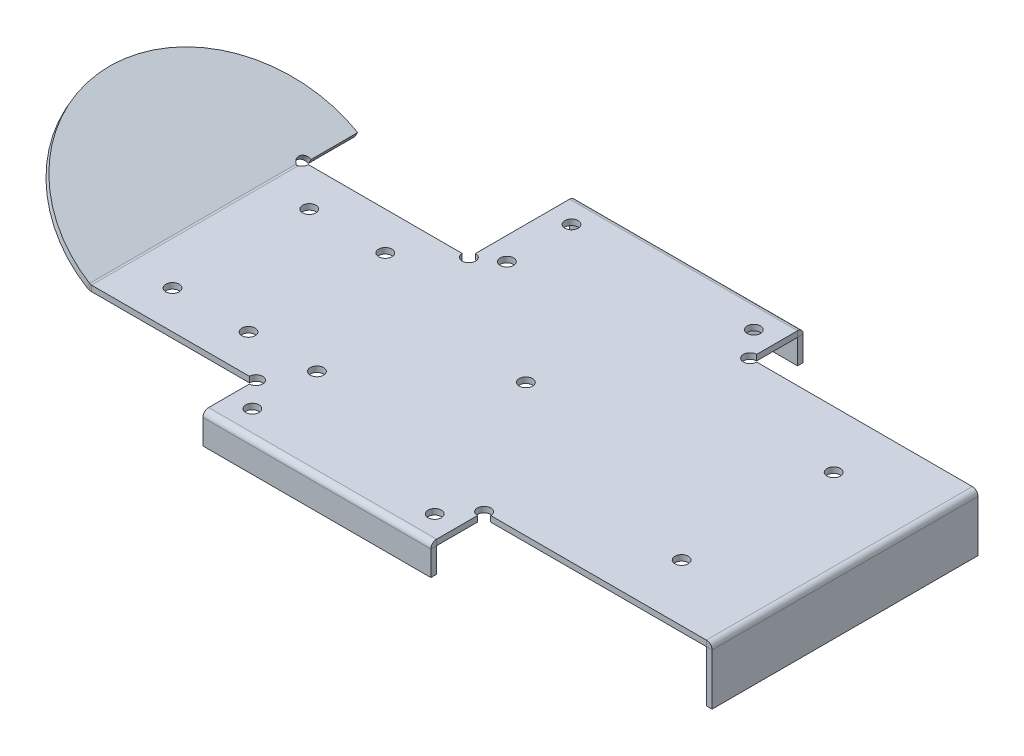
ISO-10303-21;
HEADER;
FILE_DESCRIPTION(('STEP AP214'),'2;1');
FILE_NAME('part.step','',(''),(''),'','','');
FILE_SCHEMA(('AUTOMOTIVE_DESIGN { 1 0 10303 214 1 1 1 1 }'));
ENDSEC;
DATA;
#1=APPLICATION_CONTEXT('core data for automotive mechanical design processes');
#2=APPLICATION_PROTOCOL_DEFINITION('international standard','automotive_design',2000,#1);
#3=PRODUCT_CONTEXT('',#1,'mechanical');
#4=PRODUCT('Part','Part','',(#3));
#5=PRODUCT_RELATED_PRODUCT_CATEGORY('part','',(#4));
#6=PRODUCT_DEFINITION_FORMATION('','',#4);
#7=PRODUCT_DEFINITION_CONTEXT('part definition',#1,'design');
#8=PRODUCT_DEFINITION('design','',#6,#7);
#9=PRODUCT_DEFINITION_SHAPE('','',#8);
#10=(LENGTH_UNIT() NAMED_UNIT(*) SI_UNIT(.MILLI.,.METRE.));
#11=(NAMED_UNIT(*) PLANE_ANGLE_UNIT() SI_UNIT($,.RADIAN.));
#12=(NAMED_UNIT(*) SI_UNIT($,.STERADIAN.) SOLID_ANGLE_UNIT());
#13=UNCERTAINTY_MEASURE_WITH_UNIT(LENGTH_MEASURE(1.E-05),#10,'distance_accuracy_value','');
#14=(GEOMETRIC_REPRESENTATION_CONTEXT(3) GLOBAL_UNCERTAINTY_ASSIGNED_CONTEXT((#13)) GLOBAL_UNIT_ASSIGNED_CONTEXT((#10,
#11,#12)) REPRESENTATION_CONTEXT('',''));
#15=CARTESIAN_POINT('',(0.,0.,0.));
#16=DIRECTION('',(0.,0.,1.));
#17=DIRECTION('',(1.,0.,0.));
#18=AXIS2_PLACEMENT_3D('',#15,#16,#17);
#19=CARTESIAN_POINT('',(0.,1.5,-22.));
#20=DIRECTION('',(0.,0.,-1.));
#21=DIRECTION('',(-1.,0.,0.));
#22=AXIS2_PLACEMENT_3D('',#19,#20,#21);
#23=PLANE('',#22);
#24=DIRECTION('',(1.,0.,0.));
#25=VECTOR('',#24,1.);
#26=CARTESIAN_POINT('',(0.,1.5,-22.));
#27=LINE('',#26,#25);
#28=CARTESIAN_POINT('',(0.664872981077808,1.50000000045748,-22.));
#29=VERTEX_POINT('',#28);
#30=CARTESIAN_POINT('',(42.25,1.5,-22.));
#31=VERTEX_POINT('',#30);
#32=EDGE_CURVE('E642',#29,#31,#27,.T.);
#33=ORIENTED_EDGE('',*,*,#32,.F.);
#34=DIRECTION('',(0.,-1.,0.));
#35=VECTOR('',#34,1.);
#36=CARTESIAN_POINT('',(0.664872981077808,1.5,-22.));
#37=LINE('',#36,#35);
#38=CARTESIAN_POINT('',(0.664872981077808,0.,-22.));
#39=VERTEX_POINT('',#38);
#40=EDGE_CURVE('E12',#29,#39,#37,.T.);
#41=ORIENTED_EDGE('',*,*,#40,.T.);
#42=DIRECTION('',(1.,0.,0.));
#43=VECTOR('',#42,1.);
#44=CARTESIAN_POINT('',(0.,0.,-22.));
#45=LINE('',#44,#43);
#46=CARTESIAN_POINT('',(42.25,0.,-22.));
#47=VERTEX_POINT('',#46);
#48=EDGE_CURVE('E623',#39,#47,#45,.T.);
#49=ORIENTED_EDGE('',*,*,#48,.T.);
#50=DIRECTION('',(0.,-1.,0.));
#51=VECTOR('',#50,1.);
#52=CARTESIAN_POINT('',(42.25,1.5,-22.));
#53=LINE('',#52,#51);
#54=EDGE_CURVE('E638',#31,#47,#53,.T.);
#55=ORIENTED_EDGE('',*,*,#54,.F.);
#56=EDGE_LOOP('',(#33,#41,#49,#55));
#57=FACE_BOUND('',#56,.T.);
#58=ADVANCED_FACE('F62',(#57),#23,.F.);
#59=CARTESIAN_POINT('',(0.,1.5,-78.));
#60=DIRECTION('',(0.,-1.,0.));
#61=DIRECTION('',(0.,0.,-1.));
#62=AXIS2_PLACEMENT_3D('',#59,#60,#61);
#63=CYLINDRICAL_SURFACE('',#62,1.75);
#64=CARTESIAN_POINT('',(0.,0.,-78.));
#65=DIRECTION('',(0.,-1.,0.));
#66=DIRECTION('',(0.,0.,1.));
#67=AXIS2_PLACEMENT_3D('',#64,#65,#66);
#68=CIRCLE('',#67,1.75);
#69=CARTESIAN_POINT('',(1.75,0.,-78.));
#70=VERTEX_POINT('',#69);
#71=CARTESIAN_POINT('',(0.664872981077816,4.65406359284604E-10,-76.381221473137));
#72=VERTEX_POINT('',#71);
#73=EDGE_CURVE('E618',#70,#72,#68,.T.);
#74=ORIENTED_EDGE('',*,*,#73,.T.);
#75=CARTESIAN_POINT('',(0.664872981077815,1.50000000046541,-76.381221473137));
#76=CARTESIAN_POINT('',(0.664872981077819,4.65406359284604E-10,-76.381221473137));
#77=B_SPLINE_CURVE_WITH_KNOTS('',1,(#75,#76),.UNSPECIFIED.,.F.,.F.,(2,2),(0.,1.),.UNSPECIFIED.);
#78=CARTESIAN_POINT('',(0.664872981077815,1.50000000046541,-76.381221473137));
#79=VERTEX_POINT('',#78);
#80=EDGE_CURVE('E409',#72,#79,#77,.F.);
#81=ORIENTED_EDGE('',*,*,#80,.T.);
#82=CARTESIAN_POINT('',(0.,1.5,-78.));
#83=DIRECTION('',(0.,-1.,0.));
#84=DIRECTION('',(0.,0.,1.));
#85=AXIS2_PLACEMENT_3D('',#82,#83,#84);
#86=CIRCLE('',#85,1.75);
#87=CARTESIAN_POINT('',(1.75,1.5,-78.));
#88=VERTEX_POINT('',#87);
#89=EDGE_CURVE('E637',#88,#79,#86,.T.);
#90=ORIENTED_EDGE('',*,*,#89,.F.);
#91=DIRECTION('',(0.,-1.,0.));
#92=VECTOR('',#91,1.);
#93=CARTESIAN_POINT('',(1.75,1.5,-78.));
#94=LINE('',#93,#92);
#95=EDGE_CURVE('E641',#88,#70,#94,.T.);
#96=ORIENTED_EDGE('',*,*,#95,.T.);
#97=EDGE_LOOP('',(#74,#81,#90,#96));
#98=FACE_BOUND('',#97,.T.);
#99=ADVANCED_FACE('F730',(#98),#63,.F.);
#100=CARTESIAN_POINT('',(44.,0.,-22.));
#101=DIRECTION('',(0.,1.,0.));
#102=DIRECTION('',(0.,0.,1.));
#103=AXIS2_PLACEMENT_3D('',#100,#101,#102);
#104=PLANE('',#103);
#105=CARTESIAN_POINT('',(50.,0.,-32.));
#106=DIRECTION('',(0.,1.,0.));
#107=DIRECTION('',(0.,0.,1.));
#108=AXIS2_PLACEMENT_3D('',#105,#106,#107);
#109=CIRCLE('',#108,1.75);
#110=CARTESIAN_POINT('',(50.,0.,-30.25));
#111=VERTEX_POINT('',#110);
#112=EDGE_CURVE('E524',#111,#111,#109,.T.);
#113=ORIENTED_EDGE('',*,*,#112,.T.);
#114=EDGE_LOOP('',(#113));
#115=FACE_BOUND('',#114,.T.);
#116=CARTESIAN_POINT('',(98.,0.,-15.));
#117=DIRECTION('',(0.,1.,0.));
#118=DIRECTION('',(0.,0.,1.));
#119=AXIS2_PLACEMENT_3D('',#116,#117,#118);
#120=CIRCLE('',#119,1.75);
#121=CARTESIAN_POINT('',(98.,0.,-13.25));
#122=VERTEX_POINT('',#121);
#123=EDGE_CURVE('E536',#122,#122,#120,.T.);
#124=ORIENTED_EDGE('',*,*,#123,.T.);
#125=EDGE_LOOP('',(#124));
#126=FACE_BOUND('',#125,.T.);
#127=CARTESIAN_POINT('',(50.,0.,-82.));
#128=DIRECTION('',(0.,1.,0.));
#129=DIRECTION('',(0.,0.,1.));
#130=AXIS2_PLACEMENT_3D('',#127,#128,#129);
#131=CIRCLE('',#130,1.75);
#132=CARTESIAN_POINT('',(50.,0.,-80.25));
#133=VERTEX_POINT('',#132);
#134=EDGE_CURVE('E548',#133,#133,#131,.T.);
#135=ORIENTED_EDGE('',*,*,#134,.T.);
#136=EDGE_LOOP('',(#135));
#137=FACE_BOUND('',#136,.T.);
#138=CARTESIAN_POINT('',(141.,0.,-77.));
#139=DIRECTION('',(0.,1.,0.));
#140=DIRECTION('',(0.,0.,1.));
#141=AXIS2_PLACEMENT_3D('',#138,#139,#140);
#142=CIRCLE('',#141,1.75000000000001);
#143=CARTESIAN_POINT('',(141.,0.,-75.25));
#144=VERTEX_POINT('',#143);
#145=EDGE_CURVE('E560',#144,#144,#142,.T.);
#146=ORIENTED_EDGE('',*,*,#145,.T.);
#147=EDGE_LOOP('',(#146));
#148=FACE_BOUND('',#147,.T.);
#149=CARTESIAN_POINT('',(12.,0.,-32.));
#150=DIRECTION('',(0.,1.,0.));
#151=DIRECTION('',(0.,0.,1.));
#152=AXIS2_PLACEMENT_3D('',#149,#150,#151);
#153=CIRCLE('',#152,1.75);
#154=CARTESIAN_POINT('',(12.,0.,-30.25));
#155=VERTEX_POINT('',#154);
#156=EDGE_CURVE('E572',#155,#155,#153,.T.);
#157=ORIENTED_EDGE('',*,*,#156,.T.);
#158=EDGE_LOOP('',(#157));
#159=FACE_BOUND('',#158,.T.);
#160=CARTESIAN_POINT('',(12.,0.,-68.));
#161=DIRECTION('',(0.,1.,0.));
#162=DIRECTION('',(0.,0.,1.));
#163=AXIS2_PLACEMENT_3D('',#160,#161,#162);
#164=CIRCLE('',#163,1.75);
#165=CARTESIAN_POINT('',(12.,0.,-66.25));
#166=VERTEX_POINT('',#165);
#167=EDGE_CURVE('E584',#166,#166,#164,.T.);
#168=ORIENTED_EDGE('',*,*,#167,.T.);
#169=EDGE_LOOP('',(#168));
#170=FACE_BOUND('',#169,.T.);
#171=CARTESIAN_POINT('',(50.,0.,-99.));
#172=DIRECTION('',(0.,1.,0.));
#173=DIRECTION('',(0.,0.,1.));
#174=AXIS2_PLACEMENT_3D('',#171,#172,#173);
#175=CIRCLE('',#174,1.75);
#176=CARTESIAN_POINT('',(50.,0.,-97.25));
#177=VERTEX_POINT('',#176);
#178=EDGE_CURVE('E596',#177,#177,#175,.T.);
#179=ORIENTED_EDGE('',*,*,#178,.T.);
#180=EDGE_LOOP('',(#179));
#181=FACE_BOUND('',#180,.T.);
#182=CARTESIAN_POINT('',(80.,0.,-57.));
#183=DIRECTION('',(0.,1.,0.));
#184=DIRECTION('',(0.,0.,1.));
#185=AXIS2_PLACEMENT_3D('',#182,#183,#184);
#186=CIRCLE('',#185,1.75);
#187=CARTESIAN_POINT('',(80.,0.,-55.25));
#188=VERTEX_POINT('',#187);
#189=EDGE_CURVE('E590',#188,#188,#186,.T.);
#190=ORIENTED_EDGE('',*,*,#189,.T.);
#191=EDGE_LOOP('',(#190));
#192=FACE_BOUND('',#191,.T.);
#193=CARTESIAN_POINT('',(32.,0.,-68.));
#194=DIRECTION('',(0.,1.,0.));
#195=DIRECTION('',(0.,0.,1.));
#196=AXIS2_PLACEMENT_3D('',#193,#194,#195);
#197=CIRCLE('',#196,1.75);
#198=CARTESIAN_POINT('',(32.,0.,-66.25));
#199=VERTEX_POINT('',#198);
#200=EDGE_CURVE('E578',#199,#199,#197,.T.);
#201=ORIENTED_EDGE('',*,*,#200,.T.);
#202=EDGE_LOOP('',(#201));
#203=FACE_BOUND('',#202,.T.);
#204=CARTESIAN_POINT('',(32.,0.,-32.));
#205=DIRECTION('',(0.,1.,0.));
#206=DIRECTION('',(0.,0.,1.));
#207=AXIS2_PLACEMENT_3D('',#204,#205,#206);
#208=CIRCLE('',#207,1.75);
#209=CARTESIAN_POINT('',(32.,0.,-30.25));
#210=VERTEX_POINT('',#209);
#211=EDGE_CURVE('E566',#210,#210,#208,.T.);
#212=ORIENTED_EDGE('',*,*,#211,.T.);
#213=EDGE_LOOP('',(#212));
#214=FACE_BOUND('',#213,.T.);
#215=CARTESIAN_POINT('',(141.,0.,-37.));
#216=DIRECTION('',(0.,1.,0.));
#217=DIRECTION('',(0.,0.,1.));
#218=AXIS2_PLACEMENT_3D('',#215,#216,#217);
#219=CIRCLE('',#218,1.75000000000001);
#220=CARTESIAN_POINT('',(141.,0.,-35.25));
#221=VERTEX_POINT('',#220);
#222=EDGE_CURVE('E554',#221,#221,#219,.T.);
#223=ORIENTED_EDGE('',*,*,#222,.T.);
#224=EDGE_LOOP('',(#223));
#225=FACE_BOUND('',#224,.T.);
#226=CARTESIAN_POINT('',(98.,0.,-99.));
#227=DIRECTION('',(0.,1.,0.));
#228=DIRECTION('',(0.,0.,1.));
#229=AXIS2_PLACEMENT_3D('',#226,#227,#228);
#230=CIRCLE('',#229,1.75);
#231=CARTESIAN_POINT('',(98.,0.,-97.25));
#232=VERTEX_POINT('',#231);
#233=EDGE_CURVE('E542',#232,#232,#230,.T.);
#234=ORIENTED_EDGE('',*,*,#233,.T.);
#235=EDGE_LOOP('',(#234));
#236=FACE_BOUND('',#235,.T.);
#237=CARTESIAN_POINT('',(50.,0.,-15.));
#238=DIRECTION('',(0.,1.,0.));
#239=DIRECTION('',(0.,0.,1.));
#240=AXIS2_PLACEMENT_3D('',#237,#238,#239);
#241=CIRCLE('',#240,1.75);
#242=CARTESIAN_POINT('',(50.,0.,-13.25));
#243=VERTEX_POINT('',#242);
#244=EDGE_CURVE('E530',#243,#243,#241,.T.);
#245=ORIENTED_EDGE('',*,*,#244,.T.);
#246=EDGE_LOOP('',(#245));
#247=FACE_BOUND('',#246,.T.);
#248=ORIENTED_EDGE('',*,*,#48,.F.);
#249=DIRECTION('',(0.,0.,-1.));
#250=VECTOR('',#249,1.);
#251=CARTESIAN_POINT('',(0.664872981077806,0.,-22.));
#252=LINE('',#251,#250);
#253=EDGE_CURVE('E73',#39,#72,#252,.T.);
#254=ORIENTED_EDGE('',*,*,#253,.T.);
#255=ORIENTED_EDGE('',*,*,#73,.F.);
#256=DIRECTION('',(-1.,0.,0.));
#257=VECTOR('',#256,1.);
#258=CARTESIAN_POINT('',(1.75,0.,-78.));
#259=LINE('',#258,#257);
#260=CARTESIAN_POINT('',(42.25,0.,-78.));
#261=VERTEX_POINT('',#260);
#262=EDGE_CURVE('E615',#261,#70,#259,.T.);
#263=ORIENTED_EDGE('',*,*,#262,.F.);
#264=CARTESIAN_POINT('',(44.,0.,-78.));
#265=DIRECTION('',(0.,-1.,0.));
#266=DIRECTION('',(0.,0.,1.));
#267=AXIS2_PLACEMENT_3D('',#264,#265,#266);
#268=CIRCLE('',#267,1.75);
#269=CARTESIAN_POINT('',(44.,0.,-79.75));
#270=VERTEX_POINT('',#269);
#271=EDGE_CURVE('E613',#270,#261,#268,.T.);
#272=ORIENTED_EDGE('',*,*,#271,.F.);
#273=DIRECTION('',(0.,0.,1.));
#274=VECTOR('',#273,1.);
#275=CARTESIAN_POINT('',(44.,0.,-79.75));
#276=LINE('',#275,#274);
#277=CARTESIAN_POINT('',(44.,0.,-104.505));
#278=VERTEX_POINT('',#277);
#279=EDGE_CURVE('E616',#278,#270,#276,.T.);
#280=ORIENTED_EDGE('',*,*,#279,.F.);
#281=DIRECTION('',(-1.,0.,0.));
#282=VECTOR('',#281,1.);
#283=CARTESIAN_POINT('',(44.,0.,-104.505));
#284=LINE('',#283,#282);
#285=CARTESIAN_POINT('',(104.,0.,-104.505));
#286=VERTEX_POINT('',#285);
#287=EDGE_CURVE('E671',#286,#278,#284,.T.);
#288=ORIENTED_EDGE('',*,*,#287,.F.);
#289=DIRECTION('',(0.,0.,-1.));
#290=VECTOR('',#289,1.);
#291=CARTESIAN_POINT('',(104.,0.,-93.75));
#292=LINE('',#291,#290);
#293=CARTESIAN_POINT('',(104.,0.,-93.75));
#294=VERTEX_POINT('',#293);
#295=EDGE_CURVE('E612',#294,#286,#292,.T.);
#296=ORIENTED_EDGE('',*,*,#295,.F.);
#297=CARTESIAN_POINT('',(104.,0.,-92.));
#298=DIRECTION('',(0.,-1.,0.));
#299=DIRECTION('',(0.,0.,1.));
#300=AXIS2_PLACEMENT_3D('',#297,#298,#299);
#301=CIRCLE('',#300,1.75);
#302=CARTESIAN_POINT('',(105.75,0.,-92.));
#303=VERTEX_POINT('',#302);
#304=EDGE_CURVE('E610',#303,#294,#301,.T.);
#305=ORIENTED_EDGE('',*,*,#304,.F.);
#306=DIRECTION('',(-1.,0.,0.));
#307=VECTOR('',#306,1.);
#308=CARTESIAN_POINT('',(105.75,0.,-92.));
#309=LINE('',#308,#307);
#310=CARTESIAN_POINT('',(162.505,0.,-92.));
#311=VERTEX_POINT('',#310);
#312=EDGE_CURVE('E89',#311,#303,#309,.T.);
#313=ORIENTED_EDGE('',*,*,#312,.F.);
#314=DIRECTION('',(0.,0.,-1.));
#315=VECTOR('',#314,1.);
#316=CARTESIAN_POINT('',(162.505,0.,-22.));
#317=LINE('',#316,#315);
#318=CARTESIAN_POINT('',(162.505,0.,-22.));
#319=VERTEX_POINT('',#318);
#320=EDGE_CURVE('E703',#319,#311,#317,.T.);
#321=ORIENTED_EDGE('',*,*,#320,.F.);
#322=DIRECTION('',(1.,0.,0.));
#323=VECTOR('',#322,1.);
#324=CARTESIAN_POINT('',(105.75,0.,-22.));
#325=LINE('',#324,#323);
#326=CARTESIAN_POINT('',(105.75,0.,-22.));
#327=VERTEX_POINT('',#326);
#328=EDGE_CURVE('E608',#327,#319,#325,.T.);
#329=ORIENTED_EDGE('',*,*,#328,.F.);
#330=CARTESIAN_POINT('',(104.,0.,-22.));
#331=DIRECTION('',(0.,-1.,0.));
#332=DIRECTION('',(0.,0.,1.));
#333=AXIS2_PLACEMENT_3D('',#330,#331,#332);
#334=CIRCLE('',#333,1.75);
#335=CARTESIAN_POINT('',(104.,0.,-20.25));
#336=VERTEX_POINT('',#335);
#337=EDGE_CURVE('E606',#336,#327,#334,.T.);
#338=ORIENTED_EDGE('',*,*,#337,.F.);
#339=DIRECTION('',(0.,0.,-1.));
#340=VECTOR('',#339,1.);
#341=CARTESIAN_POINT('',(104.,0.,0.));
#342=LINE('',#341,#340);
#343=CARTESIAN_POINT('',(104.,0.,-9.495));
#344=VERTEX_POINT('',#343);
#345=EDGE_CURVE('E609',#344,#336,#342,.T.);
#346=ORIENTED_EDGE('',*,*,#345,.F.);
#347=DIRECTION('',(1.,0.,0.));
#348=VECTOR('',#347,1.);
#349=CARTESIAN_POINT('',(44.,0.,-9.495));
#350=LINE('',#349,#348);
#351=CARTESIAN_POINT('',(44.,0.,-9.495));
#352=VERTEX_POINT('',#351);
#353=EDGE_CURVE('E687',#352,#344,#350,.T.);
#354=ORIENTED_EDGE('',*,*,#353,.F.);
#355=DIRECTION('',(0.,0.,1.));
#356=VECTOR('',#355,1.);
#357=CARTESIAN_POINT('',(44.,0.,0.));
#358=LINE('',#357,#356);
#359=CARTESIAN_POINT('',(44.,0.,-20.25));
#360=VERTEX_POINT('',#359);
#361=EDGE_CURVE('E605',#360,#352,#358,.T.);
#362=ORIENTED_EDGE('',*,*,#361,.F.);
#363=CARTESIAN_POINT('',(44.,0.,-22.));
#364=DIRECTION('',(0.,-1.,0.));
#365=DIRECTION('',(0.,0.,1.));
#366=AXIS2_PLACEMENT_3D('',#363,#364,#365);
#367=CIRCLE('',#366,1.75);
#368=EDGE_CURVE('E602',#47,#360,#367,.T.);
#369=ORIENTED_EDGE('',*,*,#368,.F.);
#370=EDGE_LOOP('',(#248,#254,#255,#263,#272,#280,#288,#296,#305,#313,#321,#329,#338,#346,#354,
#362,#369));
#371=FACE_BOUND('',#370,.T.);
#372=ADVANCED_FACE('F64',(#115,#126,#137,#148,#159,#170,#181,#192,#203,#214,#225,#236,#247,
#371),#104,.F.);
#373=CARTESIAN_POINT('',(44.,1.5,-22.));
#374=DIRECTION('',(0.,1.,0.));
#375=DIRECTION('',(0.,0.,1.));
#376=AXIS2_PLACEMENT_3D('',#373,#374,#375);
#377=PLANE('',#376);
#378=DIRECTION('',(0.,0.,-1.));
#379=VECTOR('',#378,1.);
#380=CARTESIAN_POINT('',(0.664872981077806,1.5,-22.));
#381=LINE('',#380,#379);
#382=EDGE_CURVE('E709',#29,#79,#381,.T.);
#383=ORIENTED_EDGE('',*,*,#382,.F.);
#384=ORIENTED_EDGE('',*,*,#32,.T.);
#385=CARTESIAN_POINT('',(44.,1.5,-22.));
#386=DIRECTION('',(0.,-1.,0.));
#387=DIRECTION('',(0.,0.,1.));
#388=AXIS2_PLACEMENT_3D('',#385,#386,#387);
#389=CIRCLE('',#388,1.75);
#390=CARTESIAN_POINT('',(44.,1.5,-20.25));
#391=VERTEX_POINT('',#390);
#392=EDGE_CURVE('E619',#31,#391,#389,.T.);
#393=ORIENTED_EDGE('',*,*,#392,.T.);
#394=DIRECTION('',(0.,0.,1.));
#395=VECTOR('',#394,1.);
#396=CARTESIAN_POINT('',(44.,1.5,0.));
#397=LINE('',#396,#395);
#398=CARTESIAN_POINT('',(44.,1.5,-9.495));
#399=VERTEX_POINT('',#398);
#400=EDGE_CURVE('E622',#391,#399,#397,.T.);
#401=ORIENTED_EDGE('',*,*,#400,.T.);
#402=DIRECTION('',(1.,0.,0.));
#403=VECTOR('',#402,1.);
#404=CARTESIAN_POINT('',(44.,1.5,-9.495));
#405=LINE('',#404,#403);
#406=CARTESIAN_POINT('',(104.,1.5,-9.495));
#407=VERTEX_POINT('',#406);
#408=EDGE_CURVE('E677',#399,#407,#405,.T.);
#409=ORIENTED_EDGE('',*,*,#408,.T.);
#410=DIRECTION('',(0.,0.,-1.));
#411=VECTOR('',#410,1.);
#412=CARTESIAN_POINT('',(104.,1.5,0.));
#413=LINE('',#412,#411);
#414=CARTESIAN_POINT('',(104.,1.5,-20.25));
#415=VERTEX_POINT('',#414);
#416=EDGE_CURVE('E627',#407,#415,#413,.T.);
#417=ORIENTED_EDGE('',*,*,#416,.T.);
#418=CARTESIAN_POINT('',(104.,1.5,-22.));
#419=DIRECTION('',(0.,-1.,0.));
#420=DIRECTION('',(0.,0.,1.));
#421=AXIS2_PLACEMENT_3D('',#418,#419,#420);
#422=CIRCLE('',#421,1.75);
#423=CARTESIAN_POINT('',(105.75,1.5,-22.));
#424=VERTEX_POINT('',#423);
#425=EDGE_CURVE('E624',#415,#424,#422,.T.);
#426=ORIENTED_EDGE('',*,*,#425,.T.);
#427=DIRECTION('',(1.,0.,0.));
#428=VECTOR('',#427,1.);
#429=CARTESIAN_POINT('',(105.75,1.5,-22.));
#430=LINE('',#429,#428);
#431=CARTESIAN_POINT('',(162.505,1.5,-22.));
#432=VERTEX_POINT('',#431);
#433=EDGE_CURVE('E626',#424,#432,#430,.T.);
#434=ORIENTED_EDGE('',*,*,#433,.T.);
#435=DIRECTION('',(0.,0.,-1.));
#436=VECTOR('',#435,1.);
#437=CARTESIAN_POINT('',(162.505,1.5,-22.));
#438=LINE('',#437,#436);
#439=CARTESIAN_POINT('',(162.505,1.5,-92.));
#440=VERTEX_POINT('',#439);
#441=EDGE_CURVE('E693',#432,#440,#438,.T.);
#442=ORIENTED_EDGE('',*,*,#441,.T.);
#443=DIRECTION('',(-1.,0.,0.));
#444=VECTOR('',#443,1.);
#445=CARTESIAN_POINT('',(105.75,1.5,-92.));
#446=LINE('',#445,#444);
#447=CARTESIAN_POINT('',(105.75,1.5,-92.));
#448=VERTEX_POINT('',#447);
#449=EDGE_CURVE('E631',#440,#448,#446,.T.);
#450=ORIENTED_EDGE('',*,*,#449,.T.);
#451=CARTESIAN_POINT('',(104.,1.5,-92.));
#452=DIRECTION('',(0.,-1.,0.));
#453=DIRECTION('',(0.,0.,1.));
#454=AXIS2_PLACEMENT_3D('',#451,#452,#453);
#455=CIRCLE('',#454,1.75);
#456=CARTESIAN_POINT('',(104.,1.5,-93.75));
#457=VERTEX_POINT('',#456);
#458=EDGE_CURVE('E628',#448,#457,#455,.T.);
#459=ORIENTED_EDGE('',*,*,#458,.T.);
#460=DIRECTION('',(0.,0.,-1.));
#461=VECTOR('',#460,1.);
#462=CARTESIAN_POINT('',(104.,1.5,-93.75));
#463=LINE('',#462,#461);
#464=CARTESIAN_POINT('',(104.,1.5,-104.505));
#465=VERTEX_POINT('',#464);
#466=EDGE_CURVE('E630',#457,#465,#463,.T.);
#467=ORIENTED_EDGE('',*,*,#466,.T.);
#468=DIRECTION('',(-1.,0.,0.));
#469=VECTOR('',#468,1.);
#470=CARTESIAN_POINT('',(44.,1.5,-104.505));
#471=LINE('',#470,#469);
#472=CARTESIAN_POINT('',(44.,1.5,-104.505));
#473=VERTEX_POINT('',#472);
#474=EDGE_CURVE('E666',#465,#473,#471,.T.);
#475=ORIENTED_EDGE('',*,*,#474,.T.);
#476=DIRECTION('',(0.,0.,1.));
#477=VECTOR('',#476,1.);
#478=CARTESIAN_POINT('',(44.,1.5,-79.75));
#479=LINE('',#478,#477);
#480=CARTESIAN_POINT('',(44.,1.5,-79.75));
#481=VERTEX_POINT('',#480);
#482=EDGE_CURVE('E635',#473,#481,#479,.T.);
#483=ORIENTED_EDGE('',*,*,#482,.T.);
#484=CARTESIAN_POINT('',(44.,1.5,-78.));
#485=DIRECTION('',(0.,-1.,0.));
#486=DIRECTION('',(0.,0.,1.));
#487=AXIS2_PLACEMENT_3D('',#484,#485,#486);
#488=CIRCLE('',#487,1.75);
#489=CARTESIAN_POINT('',(42.25,1.5,-78.));
#490=VERTEX_POINT('',#489);
#491=EDGE_CURVE('E632',#481,#490,#488,.T.);
#492=ORIENTED_EDGE('',*,*,#491,.T.);
#493=DIRECTION('',(-1.,0.,0.));
#494=VECTOR('',#493,1.);
#495=CARTESIAN_POINT('',(1.75,1.5,-78.));
#496=LINE('',#495,#494);
#497=EDGE_CURVE('E634',#490,#88,#496,.T.);
#498=ORIENTED_EDGE('',*,*,#497,.T.);
#499=ORIENTED_EDGE('',*,*,#89,.T.);
#500=EDGE_LOOP('',(#383,#384,#393,#401,#409,#417,#426,#434,#442,#450,#459,#467,#475,#483,#492,
#498,#499));
#501=FACE_BOUND('',#500,.T.);
#502=CARTESIAN_POINT('',(50.,1.5,-15.));
#503=DIRECTION('',(0.,1.,0.));
#504=DIRECTION('',(0.,0.,1.));
#505=AXIS2_PLACEMENT_3D('',#502,#503,#504);
#506=CIRCLE('',#505,1.75);
#507=CARTESIAN_POINT('',(50.,1.5,-13.25));
#508=VERTEX_POINT('',#507);
#509=EDGE_CURVE('E533',#508,#508,#506,.T.);
#510=ORIENTED_EDGE('',*,*,#509,.F.);
#511=EDGE_LOOP('',(#510));
#512=FACE_BOUND('',#511,.T.);
#513=CARTESIAN_POINT('',(98.,1.5,-99.));
#514=DIRECTION('',(0.,1.,0.));
#515=DIRECTION('',(0.,0.,1.));
#516=AXIS2_PLACEMENT_3D('',#513,#514,#515);
#517=CIRCLE('',#516,1.75);
#518=CARTESIAN_POINT('',(98.,1.5,-97.25));
#519=VERTEX_POINT('',#518);
#520=EDGE_CURVE('E545',#519,#519,#517,.T.);
#521=ORIENTED_EDGE('',*,*,#520,.F.);
#522=EDGE_LOOP('',(#521));
#523=FACE_BOUND('',#522,.T.);
#524=CARTESIAN_POINT('',(141.,1.5,-37.));
#525=DIRECTION('',(0.,1.,0.));
#526=DIRECTION('',(0.,0.,1.));
#527=AXIS2_PLACEMENT_3D('',#524,#525,#526);
#528=CIRCLE('',#527,1.75000000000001);
#529=CARTESIAN_POINT('',(141.,1.5,-35.25));
#530=VERTEX_POINT('',#529);
#531=EDGE_CURVE('E557',#530,#530,#528,.T.);
#532=ORIENTED_EDGE('',*,*,#531,.F.);
#533=EDGE_LOOP('',(#532));
#534=FACE_BOUND('',#533,.T.);
#535=CARTESIAN_POINT('',(32.,1.5,-32.));
#536=DIRECTION('',(0.,1.,0.));
#537=DIRECTION('',(0.,0.,1.));
#538=AXIS2_PLACEMENT_3D('',#535,#536,#537);
#539=CIRCLE('',#538,1.75);
#540=CARTESIAN_POINT('',(32.,1.5,-30.25));
#541=VERTEX_POINT('',#540);
#542=EDGE_CURVE('E569',#541,#541,#539,.T.);
#543=ORIENTED_EDGE('',*,*,#542,.F.);
#544=EDGE_LOOP('',(#543));
#545=FACE_BOUND('',#544,.T.);
#546=CARTESIAN_POINT('',(32.,1.5,-68.));
#547=DIRECTION('',(0.,1.,0.));
#548=DIRECTION('',(0.,0.,1.));
#549=AXIS2_PLACEMENT_3D('',#546,#547,#548);
#550=CIRCLE('',#549,1.75);
#551=CARTESIAN_POINT('',(32.,1.5,-66.25));
#552=VERTEX_POINT('',#551);
#553=EDGE_CURVE('E581',#552,#552,#550,.T.);
#554=ORIENTED_EDGE('',*,*,#553,.F.);
#555=EDGE_LOOP('',(#554));
#556=FACE_BOUND('',#555,.T.);
#557=CARTESIAN_POINT('',(80.,1.5,-57.));
#558=DIRECTION('',(0.,1.,0.));
#559=DIRECTION('',(0.,0.,1.));
#560=AXIS2_PLACEMENT_3D('',#557,#558,#559);
#561=CIRCLE('',#560,1.75);
#562=CARTESIAN_POINT('',(80.,1.5,-55.25));
#563=VERTEX_POINT('',#562);
#564=EDGE_CURVE('E593',#563,#563,#561,.T.);
#565=ORIENTED_EDGE('',*,*,#564,.F.);
#566=EDGE_LOOP('',(#565));
#567=FACE_BOUND('',#566,.T.);
#568=CARTESIAN_POINT('',(50.,1.5,-99.));
#569=DIRECTION('',(0.,1.,0.));
#570=DIRECTION('',(0.,0.,1.));
#571=AXIS2_PLACEMENT_3D('',#568,#569,#570);
#572=CIRCLE('',#571,1.75);
#573=CARTESIAN_POINT('',(50.,1.5,-97.25));
#574=VERTEX_POINT('',#573);
#575=EDGE_CURVE('E599',#574,#574,#572,.T.);
#576=ORIENTED_EDGE('',*,*,#575,.F.);
#577=EDGE_LOOP('',(#576));
#578=FACE_BOUND('',#577,.T.);
#579=CARTESIAN_POINT('',(12.,1.5,-68.));
#580=DIRECTION('',(0.,1.,0.));
#581=DIRECTION('',(0.,0.,1.));
#582=AXIS2_PLACEMENT_3D('',#579,#580,#581);
#583=CIRCLE('',#582,1.75);
#584=CARTESIAN_POINT('',(12.,1.5,-66.25));
#585=VERTEX_POINT('',#584);
#586=EDGE_CURVE('E587',#585,#585,#583,.T.);
#587=ORIENTED_EDGE('',*,*,#586,.F.);
#588=EDGE_LOOP('',(#587));
#589=FACE_BOUND('',#588,.T.);
#590=CARTESIAN_POINT('',(12.,1.5,-32.));
#591=DIRECTION('',(0.,1.,0.));
#592=DIRECTION('',(0.,0.,1.));
#593=AXIS2_PLACEMENT_3D('',#590,#591,#592);
#594=CIRCLE('',#593,1.75);
#595=CARTESIAN_POINT('',(12.,1.5,-30.25));
#596=VERTEX_POINT('',#595);
#597=EDGE_CURVE('E575',#596,#596,#594,.T.);
#598=ORIENTED_EDGE('',*,*,#597,.F.);
#599=EDGE_LOOP('',(#598));
#600=FACE_BOUND('',#599,.T.);
#601=CARTESIAN_POINT('',(141.,1.5,-77.));
#602=DIRECTION('',(0.,1.,0.));
#603=DIRECTION('',(0.,0.,1.));
#604=AXIS2_PLACEMENT_3D('',#601,#602,#603);
#605=CIRCLE('',#604,1.75000000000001);
#606=CARTESIAN_POINT('',(141.,1.5,-75.25));
#607=VERTEX_POINT('',#606);
#608=EDGE_CURVE('E563',#607,#607,#605,.T.);
#609=ORIENTED_EDGE('',*,*,#608,.F.);
#610=EDGE_LOOP('',(#609));
#611=FACE_BOUND('',#610,.T.);
#612=CARTESIAN_POINT('',(50.,1.5,-82.));
#613=DIRECTION('',(0.,1.,0.));
#614=DIRECTION('',(0.,0.,1.));
#615=AXIS2_PLACEMENT_3D('',#612,#613,#614);
#616=CIRCLE('',#615,1.75);
#617=CARTESIAN_POINT('',(50.,1.5,-80.25));
#618=VERTEX_POINT('',#617);
#619=EDGE_CURVE('E551',#618,#618,#616,.T.);
#620=ORIENTED_EDGE('',*,*,#619,.F.);
#621=EDGE_LOOP('',(#620));
#622=FACE_BOUND('',#621,.T.);
#623=CARTESIAN_POINT('',(98.,1.5,-15.));
#624=DIRECTION('',(0.,1.,0.));
#625=DIRECTION('',(0.,0.,1.));
#626=AXIS2_PLACEMENT_3D('',#623,#624,#625);
#627=CIRCLE('',#626,1.75);
#628=CARTESIAN_POINT('',(98.,1.5,-13.25));
#629=VERTEX_POINT('',#628);
#630=EDGE_CURVE('E539',#629,#629,#627,.T.);
#631=ORIENTED_EDGE('',*,*,#630,.F.);
#632=EDGE_LOOP('',(#631));
#633=FACE_BOUND('',#632,.T.);
#634=CARTESIAN_POINT('',(50.,1.5,-32.));
#635=DIRECTION('',(0.,1.,0.));
#636=DIRECTION('',(0.,0.,1.));
#637=AXIS2_PLACEMENT_3D('',#634,#635,#636);
#638=CIRCLE('',#637,1.75);
#639=CARTESIAN_POINT('',(50.,1.5,-30.25));
#640=VERTEX_POINT('',#639);
#641=EDGE_CURVE('E527',#640,#640,#638,.T.);
#642=ORIENTED_EDGE('',*,*,#641,.F.);
#643=EDGE_LOOP('',(#642));
#644=FACE_BOUND('',#643,.T.);
#645=ADVANCED_FACE('F739',(#501,#512,#523,#534,#545,#556,#567,#578,#589,#600,#611,#622,#633,
#644),#377,.T.);
#646=CARTESIAN_POINT('',(44.,1.5,-22.));
#647=DIRECTION('',(0.,-1.,0.));
#648=DIRECTION('',(0.,0.,-1.));
#649=AXIS2_PLACEMENT_3D('',#646,#647,#648);
#650=CYLINDRICAL_SURFACE('',#649,1.75);
#651=ORIENTED_EDGE('',*,*,#368,.T.);
#652=DIRECTION('',(0.,-1.,0.));
#653=VECTOR('',#652,1.);
#654=CARTESIAN_POINT('',(44.,1.5,-20.25));
#655=LINE('',#654,#653);
#656=EDGE_CURVE('E663',#391,#360,#655,.T.);
#657=ORIENTED_EDGE('',*,*,#656,.F.);
#658=ORIENTED_EDGE('',*,*,#392,.F.);
#659=ORIENTED_EDGE('',*,*,#54,.T.);
#660=EDGE_LOOP('',(#651,#657,#658,#659));
#661=FACE_BOUND('',#660,.T.);
#662=ADVANCED_FACE('F742',(#661),#650,.F.);
#663=CARTESIAN_POINT('',(44.,1.5,0.));
#664=DIRECTION('',(1.,0.,0.));
#665=DIRECTION('',(0.,0.,-1.));
#666=AXIS2_PLACEMENT_3D('',#663,#664,#665);
#667=PLANE('',#666);
#668=DIRECTION('',(0.,-1.,0.));
#669=VECTOR('',#668,1.);
#670=CARTESIAN_POINT('',(44.,1.5,-9.495));
#671=LINE('',#670,#669);
#672=EDGE_CURVE('E685',#399,#352,#671,.T.);
#673=ORIENTED_EDGE('',*,*,#672,.F.);
#674=ORIENTED_EDGE('',*,*,#400,.F.);
#675=ORIENTED_EDGE('',*,*,#656,.T.);
#676=ORIENTED_EDGE('',*,*,#361,.T.);
#677=EDGE_LOOP('',(#673,#674,#675,#676));
#678=FACE_BOUND('',#677,.T.);
#679=ADVANCED_FACE('F760',(#678),#667,.F.);
#680=CARTESIAN_POINT('',(104.,1.5,0.));
#681=DIRECTION('',(-1.,0.,0.));
#682=DIRECTION('',(0.,0.,1.));
#683=AXIS2_PLACEMENT_3D('',#680,#681,#682);
#684=PLANE('',#683);
#685=DIRECTION('',(0.,1.,0.));
#686=VECTOR('',#685,1.);
#687=CARTESIAN_POINT('',(104.,1.5,-9.495));
#688=LINE('',#687,#686);
#689=EDGE_CURVE('E690',#344,#407,#688,.T.);
#690=ORIENTED_EDGE('',*,*,#689,.F.);
#691=ORIENTED_EDGE('',*,*,#345,.T.);
#692=DIRECTION('',(0.,-1.,0.));
#693=VECTOR('',#692,1.);
#694=CARTESIAN_POINT('',(104.,1.5,-20.25));
#695=LINE('',#694,#693);
#696=EDGE_CURVE('E660',#415,#336,#695,.T.);
#697=ORIENTED_EDGE('',*,*,#696,.F.);
#698=ORIENTED_EDGE('',*,*,#416,.F.);
#699=EDGE_LOOP('',(#690,#691,#697,#698));
#700=FACE_BOUND('',#699,.T.);
#701=ADVANCED_FACE('F757',(#700),#684,.F.);
#702=CARTESIAN_POINT('',(104.,1.5,-22.));
#703=DIRECTION('',(0.,-1.,0.));
#704=DIRECTION('',(0.,0.,-1.));
#705=AXIS2_PLACEMENT_3D('',#702,#703,#704);
#706=CYLINDRICAL_SURFACE('',#705,1.75);
#707=ORIENTED_EDGE('',*,*,#337,.T.);
#708=DIRECTION('',(0.,-1.,0.));
#709=VECTOR('',#708,1.);
#710=CARTESIAN_POINT('',(105.75,1.5,-22.));
#711=LINE('',#710,#709);
#712=EDGE_CURVE('E657',#424,#327,#711,.T.);
#713=ORIENTED_EDGE('',*,*,#712,.F.);
#714=ORIENTED_EDGE('',*,*,#425,.F.);
#715=ORIENTED_EDGE('',*,*,#696,.T.);
#716=EDGE_LOOP('',(#707,#713,#714,#715));
#717=FACE_BOUND('',#716,.T.);
#718=ADVANCED_FACE('F755',(#717),#706,.F.);
#719=CARTESIAN_POINT('',(105.75,1.5,-22.));
#720=DIRECTION('',(0.,0.,-1.));
#721=DIRECTION('',(-1.,0.,0.));
#722=AXIS2_PLACEMENT_3D('',#719,#720,#721);
#723=PLANE('',#722);
#724=DIRECTION('',(0.,-1.,0.));
#725=VECTOR('',#724,1.);
#726=CARTESIAN_POINT('',(162.505,1.5,-22.));
#727=LINE('',#726,#725);
#728=EDGE_CURVE('E701',#432,#319,#727,.T.);
#729=ORIENTED_EDGE('',*,*,#728,.F.);
#730=ORIENTED_EDGE('',*,*,#433,.F.);
#731=ORIENTED_EDGE('',*,*,#712,.T.);
#732=ORIENTED_EDGE('',*,*,#328,.T.);
#733=EDGE_LOOP('',(#729,#730,#731,#732));
#734=FACE_BOUND('',#733,.T.);
#735=ADVANCED_FACE('F751',(#734),#723,.F.);
#736=CARTESIAN_POINT('',(105.75,1.5,-92.));
#737=DIRECTION('',(0.,0.,1.));
#738=DIRECTION('',(1.,0.,0.));
#739=AXIS2_PLACEMENT_3D('',#736,#737,#738);
#740=PLANE('',#739);
#741=DIRECTION('',(0.,1.,0.));
#742=VECTOR('',#741,1.);
#743=CARTESIAN_POINT('',(162.505,1.5,-92.));
#744=LINE('',#743,#742);
#745=EDGE_CURVE('E706',#311,#440,#744,.T.);
#746=ORIENTED_EDGE('',*,*,#745,.F.);
#747=ORIENTED_EDGE('',*,*,#312,.T.);
#748=DIRECTION('',(0.,-1.,0.));
#749=VECTOR('',#748,1.);
#750=CARTESIAN_POINT('',(105.75,1.5,-92.));
#751=LINE('',#750,#749);
#752=EDGE_CURVE('E654',#448,#303,#751,.T.);
#753=ORIENTED_EDGE('',*,*,#752,.F.);
#754=ORIENTED_EDGE('',*,*,#449,.F.);
#755=EDGE_LOOP('',(#746,#747,#753,#754));
#756=FACE_BOUND('',#755,.T.);
#757=ADVANCED_FACE('F747',(#756),#740,.F.);
#758=CARTESIAN_POINT('',(104.,1.5,-92.));
#759=DIRECTION('',(0.,-1.,0.));
#760=DIRECTION('',(0.,0.,-1.));
#761=AXIS2_PLACEMENT_3D('',#758,#759,#760);
#762=CYLINDRICAL_SURFACE('',#761,1.75);
#763=ORIENTED_EDGE('',*,*,#304,.T.);
#764=DIRECTION('',(0.,-1.,0.));
#765=VECTOR('',#764,1.);
#766=CARTESIAN_POINT('',(104.,1.5,-93.75));
#767=LINE('',#766,#765);
#768=EDGE_CURVE('E651',#457,#294,#767,.T.);
#769=ORIENTED_EDGE('',*,*,#768,.F.);
#770=ORIENTED_EDGE('',*,*,#458,.F.);
#771=ORIENTED_EDGE('',*,*,#752,.T.);
#772=EDGE_LOOP('',(#763,#769,#770,#771));
#773=FACE_BOUND('',#772,.T.);
#774=ADVANCED_FACE('F750',(#773),#762,.F.);
#775=CARTESIAN_POINT('',(104.,1.5,-93.75));
#776=DIRECTION('',(-1.,0.,0.));
#777=DIRECTION('',(0.,0.,1.));
#778=AXIS2_PLACEMENT_3D('',#775,#776,#777);
#779=PLANE('',#778);
#780=DIRECTION('',(0.,-1.,0.));
#781=VECTOR('',#780,1.);
#782=CARTESIAN_POINT('',(104.,1.5,-104.505));
#783=LINE('',#782,#781);
#784=EDGE_CURVE('E669',#465,#286,#783,.T.);
#785=ORIENTED_EDGE('',*,*,#784,.F.);
#786=ORIENTED_EDGE('',*,*,#466,.F.);
#787=ORIENTED_EDGE('',*,*,#768,.T.);
#788=ORIENTED_EDGE('',*,*,#295,.T.);
#789=EDGE_LOOP('',(#785,#786,#787,#788));
#790=FACE_BOUND('',#789,.T.);
#791=ADVANCED_FACE('F769',(#790),#779,.F.);
#792=CARTESIAN_POINT('',(44.,1.5,-79.75));
#793=DIRECTION('',(1.,0.,0.));
#794=DIRECTION('',(0.,0.,-1.));
#795=AXIS2_PLACEMENT_3D('',#792,#793,#794);
#796=PLANE('',#795);
#797=DIRECTION('',(0.,1.,0.));
#798=VECTOR('',#797,1.);
#799=CARTESIAN_POINT('',(44.,1.5,-104.505));
#800=LINE('',#799,#798);
#801=EDGE_CURVE('E674',#278,#473,#800,.T.);
#802=ORIENTED_EDGE('',*,*,#801,.F.);
#803=ORIENTED_EDGE('',*,*,#279,.T.);
#804=DIRECTION('',(0.,-1.,0.));
#805=VECTOR('',#804,1.);
#806=CARTESIAN_POINT('',(44.,1.5,-79.75));
#807=LINE('',#806,#805);
#808=EDGE_CURVE('E648',#481,#270,#807,.T.);
#809=ORIENTED_EDGE('',*,*,#808,.F.);
#810=ORIENTED_EDGE('',*,*,#482,.F.);
#811=EDGE_LOOP('',(#802,#803,#809,#810));
#812=FACE_BOUND('',#811,.T.);
#813=ADVANCED_FACE('F765',(#812),#796,.F.);
#814=CARTESIAN_POINT('',(44.,1.5,-78.));
#815=DIRECTION('',(0.,-1.,0.));
#816=DIRECTION('',(0.,0.,-1.));
#817=AXIS2_PLACEMENT_3D('',#814,#815,#816);
#818=CYLINDRICAL_SURFACE('',#817,1.75);
#819=ORIENTED_EDGE('',*,*,#271,.T.);
#820=DIRECTION('',(0.,-1.,0.));
#821=VECTOR('',#820,1.);
#822=CARTESIAN_POINT('',(42.25,1.5,-78.));
#823=LINE('',#822,#821);
#824=EDGE_CURVE('E645',#490,#261,#823,.T.);
#825=ORIENTED_EDGE('',*,*,#824,.F.);
#826=ORIENTED_EDGE('',*,*,#491,.F.);
#827=ORIENTED_EDGE('',*,*,#808,.T.);
#828=EDGE_LOOP('',(#819,#825,#826,#827));
#829=FACE_BOUND('',#828,.T.);
#830=ADVANCED_FACE('F768',(#829),#818,.F.);
#831=CARTESIAN_POINT('',(1.75,1.5,-78.));
#832=DIRECTION('',(0.,0.,1.));
#833=DIRECTION('',(1.,0.,0.));
#834=AXIS2_PLACEMENT_3D('',#831,#832,#833);
#835=PLANE('',#834);
#836=ORIENTED_EDGE('',*,*,#262,.T.);
#837=ORIENTED_EDGE('',*,*,#95,.F.);
#838=ORIENTED_EDGE('',*,*,#497,.F.);
#839=ORIENTED_EDGE('',*,*,#824,.T.);
#840=EDGE_LOOP('',(#836,#837,#838,#839));
#841=FACE_BOUND('',#840,.T.);
#842=ADVANCED_FACE('F785',(#841),#835,.F.);
#843=CARTESIAN_POINT('',(50.,1.5,-99.));
#844=DIRECTION('',(0.,-1.,0.));
#845=DIRECTION('',(0.,0.,-1.));
#846=AXIS2_PLACEMENT_3D('',#843,#844,#845);
#847=CYLINDRICAL_SURFACE('',#846,1.75);
#848=ORIENTED_EDGE('',*,*,#575,.T.);
#849=EDGE_LOOP('',(#848));
#850=FACE_BOUND('',#849,.T.);
#851=ORIENTED_EDGE('',*,*,#178,.F.);
#852=EDGE_LOOP('',(#851));
#853=FACE_BOUND('',#852,.T.);
#854=ADVANCED_FACE('F789',(#850,#853),#847,.F.);
#855=CARTESIAN_POINT('',(80.,1.5,-57.));
#856=DIRECTION('',(0.,-1.,0.));
#857=DIRECTION('',(0.,0.,-1.));
#858=AXIS2_PLACEMENT_3D('',#855,#856,#857);
#859=CYLINDRICAL_SURFACE('',#858,1.75);
#860=ORIENTED_EDGE('',*,*,#564,.T.);
#861=EDGE_LOOP('',(#860));
#862=FACE_BOUND('',#861,.T.);
#863=ORIENTED_EDGE('',*,*,#189,.F.);
#864=EDGE_LOOP('',(#863));
#865=FACE_BOUND('',#864,.T.);
#866=ADVANCED_FACE('F793',(#862,#865),#859,.F.);
#867=CARTESIAN_POINT('',(12.,1.5,-68.));
#868=DIRECTION('',(0.,-1.,0.));
#869=DIRECTION('',(0.,0.,-1.));
#870=AXIS2_PLACEMENT_3D('',#867,#868,#869);
#871=CYLINDRICAL_SURFACE('',#870,1.75);
#872=ORIENTED_EDGE('',*,*,#586,.T.);
#873=EDGE_LOOP('',(#872));
#874=FACE_BOUND('',#873,.T.);
#875=ORIENTED_EDGE('',*,*,#167,.F.);
#876=EDGE_LOOP('',(#875));
#877=FACE_BOUND('',#876,.T.);
#878=ADVANCED_FACE('F797',(#874,#877),#871,.F.);
#879=CARTESIAN_POINT('',(32.,1.5,-68.));
#880=DIRECTION('',(0.,-1.,0.));
#881=DIRECTION('',(0.,0.,-1.));
#882=AXIS2_PLACEMENT_3D('',#879,#880,#881);
#883=CYLINDRICAL_SURFACE('',#882,1.75);
#884=ORIENTED_EDGE('',*,*,#553,.T.);
#885=EDGE_LOOP('',(#884));
#886=FACE_BOUND('',#885,.T.);
#887=ORIENTED_EDGE('',*,*,#200,.F.);
#888=EDGE_LOOP('',(#887));
#889=FACE_BOUND('',#888,.T.);
#890=ADVANCED_FACE('F801',(#886,#889),#883,.F.);
#891=CARTESIAN_POINT('',(12.,1.5,-32.));
#892=DIRECTION('',(0.,-1.,0.));
#893=DIRECTION('',(0.,0.,-1.));
#894=AXIS2_PLACEMENT_3D('',#891,#892,#893);
#895=CYLINDRICAL_SURFACE('',#894,1.75);
#896=ORIENTED_EDGE('',*,*,#597,.T.);
#897=EDGE_LOOP('',(#896));
#898=FACE_BOUND('',#897,.T.);
#899=ORIENTED_EDGE('',*,*,#156,.F.);
#900=EDGE_LOOP('',(#899));
#901=FACE_BOUND('',#900,.T.);
#902=ADVANCED_FACE('F805',(#898,#901),#895,.F.);
#903=CARTESIAN_POINT('',(32.,1.5,-32.));
#904=DIRECTION('',(0.,-1.,0.));
#905=DIRECTION('',(0.,0.,-1.));
#906=AXIS2_PLACEMENT_3D('',#903,#904,#905);
#907=CYLINDRICAL_SURFACE('',#906,1.75);
#908=ORIENTED_EDGE('',*,*,#542,.T.);
#909=EDGE_LOOP('',(#908));
#910=FACE_BOUND('',#909,.T.);
#911=ORIENTED_EDGE('',*,*,#211,.F.);
#912=EDGE_LOOP('',(#911));
#913=FACE_BOUND('',#912,.T.);
#914=ADVANCED_FACE('F809',(#910,#913),#907,.F.);
#915=CARTESIAN_POINT('',(141.,1.5,-77.));
#916=DIRECTION('',(0.,-1.,0.));
#917=DIRECTION('',(0.,0.,-1.));
#918=AXIS2_PLACEMENT_3D('',#915,#916,#917);
#919=CYLINDRICAL_SURFACE('',#918,1.75000000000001);
#920=ORIENTED_EDGE('',*,*,#608,.T.);
#921=EDGE_LOOP('',(#920));
#922=FACE_BOUND('',#921,.T.);
#923=ORIENTED_EDGE('',*,*,#145,.F.);
#924=EDGE_LOOP('',(#923));
#925=FACE_BOUND('',#924,.T.);
#926=ADVANCED_FACE('F813',(#922,#925),#919,.F.);
#927=CARTESIAN_POINT('',(141.,1.5,-37.));
#928=DIRECTION('',(0.,-1.,0.));
#929=DIRECTION('',(0.,0.,-1.));
#930=AXIS2_PLACEMENT_3D('',#927,#928,#929);
#931=CYLINDRICAL_SURFACE('',#930,1.75000000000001);
#932=ORIENTED_EDGE('',*,*,#531,.T.);
#933=EDGE_LOOP('',(#932));
#934=FACE_BOUND('',#933,.T.);
#935=ORIENTED_EDGE('',*,*,#222,.F.);
#936=EDGE_LOOP('',(#935));
#937=FACE_BOUND('',#936,.T.);
#938=ADVANCED_FACE('F817',(#934,#937),#931,.F.);
#939=CARTESIAN_POINT('',(50.,1.5,-82.));
#940=DIRECTION('',(0.,-1.,0.));
#941=DIRECTION('',(0.,0.,-1.));
#942=AXIS2_PLACEMENT_3D('',#939,#940,#941);
#943=CYLINDRICAL_SURFACE('',#942,1.75);
#944=ORIENTED_EDGE('',*,*,#619,.T.);
#945=EDGE_LOOP('',(#944));
#946=FACE_BOUND('',#945,.T.);
#947=ORIENTED_EDGE('',*,*,#134,.F.);
#948=EDGE_LOOP('',(#947));
#949=FACE_BOUND('',#948,.T.);
#950=ADVANCED_FACE('F821',(#946,#949),#943,.F.);
#951=CARTESIAN_POINT('',(98.,1.5,-99.));
#952=DIRECTION('',(0.,-1.,0.));
#953=DIRECTION('',(0.,0.,-1.));
#954=AXIS2_PLACEMENT_3D('',#951,#952,#953);
#955=CYLINDRICAL_SURFACE('',#954,1.75);
#956=ORIENTED_EDGE('',*,*,#520,.T.);
#957=EDGE_LOOP('',(#956));
#958=FACE_BOUND('',#957,.T.);
#959=ORIENTED_EDGE('',*,*,#233,.F.);
#960=EDGE_LOOP('',(#959));
#961=FACE_BOUND('',#960,.T.);
#962=ADVANCED_FACE('F825',(#958,#961),#955,.F.);
#963=CARTESIAN_POINT('',(98.,1.5,-15.));
#964=DIRECTION('',(0.,-1.,0.));
#965=DIRECTION('',(0.,0.,-1.));
#966=AXIS2_PLACEMENT_3D('',#963,#964,#965);
#967=CYLINDRICAL_SURFACE('',#966,1.75);
#968=ORIENTED_EDGE('',*,*,#630,.T.);
#969=EDGE_LOOP('',(#968));
#970=FACE_BOUND('',#969,.T.);
#971=ORIENTED_EDGE('',*,*,#123,.F.);
#972=EDGE_LOOP('',(#971));
#973=FACE_BOUND('',#972,.T.);
#974=ADVANCED_FACE('F829',(#970,#973),#967,.F.);
#975=CARTESIAN_POINT('',(50.,1.5,-15.));
#976=DIRECTION('',(0.,-1.,0.));
#977=DIRECTION('',(0.,0.,-1.));
#978=AXIS2_PLACEMENT_3D('',#975,#976,#977);
#979=CYLINDRICAL_SURFACE('',#978,1.75);
#980=ORIENTED_EDGE('',*,*,#509,.T.);
#981=EDGE_LOOP('',(#980));
#982=FACE_BOUND('',#981,.T.);
#983=ORIENTED_EDGE('',*,*,#244,.F.);
#984=EDGE_LOOP('',(#983));
#985=FACE_BOUND('',#984,.T.);
#986=ADVANCED_FACE('F833',(#982,#985),#979,.F.);
#987=CARTESIAN_POINT('',(50.,1.5,-32.));
#988=DIRECTION('',(0.,-1.,0.));
#989=DIRECTION('',(0.,0.,-1.));
#990=AXIS2_PLACEMENT_3D('',#987,#988,#989);
#991=CYLINDRICAL_SURFACE('',#990,1.75);
#992=ORIENTED_EDGE('',*,*,#641,.T.);
#993=EDGE_LOOP('',(#992));
#994=FACE_BOUND('',#993,.T.);
#995=ORIENTED_EDGE('',*,*,#112,.F.);
#996=EDGE_LOOP('',(#995));
#997=FACE_BOUND('',#996,.T.);
#998=ADVANCED_FACE('F837',(#994,#997),#991,.F.);
#999=CARTESIAN_POINT('',(104.,0.,-104.505));
#1000=DIRECTION('',(1.,0.,0.));
#1001=DIRECTION('',(0.,0.,-1.));
#1002=AXIS2_PLACEMENT_3D('',#999,#1000,#1001);
#1003=CYLINDRICAL_SURFACE('',#1002,1.50000000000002);
#1004=CARTESIAN_POINT('',(104.,0.,-104.505));
#1005=DIRECTION('',(1.,0.,0.));
#1006=DIRECTION('',(0.,0.,-1.));
#1007=AXIS2_PLACEMENT_3D('',#1004,#1005,#1006);
#1008=CIRCLE('',#1007,1.50000000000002);
#1009=CARTESIAN_POINT('',(104.,0.,-106.005));
#1010=VERTEX_POINT('',#1009);
#1011=EDGE_CURVE('E521',#1010,#465,#1008,.T.);
#1012=ORIENTED_EDGE('',*,*,#1011,.F.);
#1013=DIRECTION('',(-1.,0.,0.));
#1014=VECTOR('',#1013,1.);
#1015=CARTESIAN_POINT('',(44.,0.,-106.005));
#1016=LINE('',#1015,#1014);
#1017=CARTESIAN_POINT('',(44.,0.,-106.005));
#1018=VERTEX_POINT('',#1017);
#1019=EDGE_CURVE('E489',#1010,#1018,#1016,.T.);
#1020=ORIENTED_EDGE('',*,*,#1019,.T.);
#1021=CARTESIAN_POINT('',(44.,0.,-104.505));
#1022=DIRECTION('',(1.,0.,0.));
#1023=DIRECTION('',(0.,0.,-1.));
#1024=AXIS2_PLACEMENT_3D('',#1021,#1022,#1023);
#1025=CIRCLE('',#1024,1.50000000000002);
#1026=EDGE_CURVE('E493',#1018,#473,#1025,.T.);
#1027=ORIENTED_EDGE('',*,*,#1026,.T.);
#1028=ORIENTED_EDGE('',*,*,#474,.F.);
#1029=EDGE_LOOP('',(#1012,#1020,#1027,#1028));
#1030=FACE_BOUND('',#1029,.T.);
#1031=ADVANCED_FACE('F841',(#1030),#1003,.T.);
#1032=CARTESIAN_POINT('',(104.,0.,-106.005));
#1033=DIRECTION('',(-1.,0.,0.));
#1034=DIRECTION('',(0.,0.,1.));
#1035=AXIS2_PLACEMENT_3D('',#1032,#1033,#1034);
#1036=PLANE('',#1035);
#1037=ORIENTED_EDGE('',*,*,#784,.T.);
#1038=DIRECTION('',(0.,0.,1.));
#1039=VECTOR('',#1038,1.);
#1040=CARTESIAN_POINT('',(104.,0.,-106.005));
#1041=LINE('',#1040,#1039);
#1042=EDGE_CURVE('E502',#1010,#286,#1041,.T.);
#1043=ORIENTED_EDGE('',*,*,#1042,.F.);
#1044=ORIENTED_EDGE('',*,*,#1011,.T.);
#1045=EDGE_LOOP('',(#1037,#1043,#1044));
#1046=FACE_BOUND('',#1045,.T.);
#1047=ADVANCED_FACE('F843',(#1046),#1036,.F.);
#1048=CARTESIAN_POINT('',(44.,0.,-106.005));
#1049=DIRECTION('',(1.,0.,0.));
#1050=DIRECTION('',(0.,0.,-1.));
#1051=AXIS2_PLACEMENT_3D('',#1048,#1049,#1050);
#1052=PLANE('',#1051);
#1053=DIRECTION('',(0.,0.,-1.));
#1054=VECTOR('',#1053,1.);
#1055=CARTESIAN_POINT('',(44.,0.,-106.005));
#1056=LINE('',#1055,#1054);
#1057=EDGE_CURVE('E494',#278,#1018,#1056,.T.);
#1058=ORIENTED_EDGE('',*,*,#1057,.F.);
#1059=ORIENTED_EDGE('',*,*,#801,.T.);
#1060=ORIENTED_EDGE('',*,*,#1026,.F.);
#1061=EDGE_LOOP('',(#1058,#1059,#1060));
#1062=FACE_BOUND('',#1061,.T.);
#1063=ADVANCED_FACE('F846',(#1062),#1052,.F.);
#1064=CARTESIAN_POINT('',(44.,-6.50499999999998,-106.005));
#1065=DIRECTION('',(0.,1.,0.));
#1066=DIRECTION('',(1.,0.,0.));
#1067=AXIS2_PLACEMENT_3D('',#1064,#1065,#1066);
#1068=PLANE('',#1067);
#1069=DIRECTION('',(-1.,0.,0.));
#1070=VECTOR('',#1069,1.);
#1071=CARTESIAN_POINT('',(44.,-6.50499999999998,-104.505));
#1072=LINE('',#1071,#1070);
#1073=CARTESIAN_POINT('',(104.,-6.50499999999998,-104.505));
#1074=VERTEX_POINT('',#1073);
#1075=CARTESIAN_POINT('',(44.,-6.50499999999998,-104.505));
#1076=VERTEX_POINT('',#1075);
#1077=EDGE_CURVE('E515',#1074,#1076,#1072,.T.);
#1078=ORIENTED_EDGE('',*,*,#1077,.T.);
#1079=DIRECTION('',(0.,0.,1.));
#1080=VECTOR('',#1079,1.);
#1081=CARTESIAN_POINT('',(44.,-6.50499999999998,-106.005));
#1082=LINE('',#1081,#1080);
#1083=CARTESIAN_POINT('',(44.,-6.50499999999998,-106.005));
#1084=VERTEX_POINT('',#1083);
#1085=EDGE_CURVE('E490',#1084,#1076,#1082,.T.);
#1086=ORIENTED_EDGE('',*,*,#1085,.F.);
#1087=DIRECTION('',(-1.,0.,0.));
#1088=VECTOR('',#1087,1.);
#1089=CARTESIAN_POINT('',(44.,-6.50499999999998,-106.005));
#1090=LINE('',#1089,#1088);
#1091=CARTESIAN_POINT('',(104.,-6.50499999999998,-106.005));
#1092=VERTEX_POINT('',#1091);
#1093=EDGE_CURVE('E508',#1092,#1084,#1090,.T.);
#1094=ORIENTED_EDGE('',*,*,#1093,.F.);
#1095=DIRECTION('',(0.,0.,1.));
#1096=VECTOR('',#1095,1.);
#1097=CARTESIAN_POINT('',(104.,-6.50499999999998,-106.005));
#1098=LINE('',#1097,#1096);
#1099=EDGE_CURVE('E512',#1092,#1074,#1098,.T.);
#1100=ORIENTED_EDGE('',*,*,#1099,.T.);
#1101=EDGE_LOOP('',(#1078,#1086,#1094,#1100));
#1102=FACE_BOUND('',#1101,.T.);
#1103=ADVANCED_FACE('F850',(#1102),#1068,.F.);
#1104=CARTESIAN_POINT('',(44.,85.495,-106.005));
#1105=DIRECTION('',(0.,0.,-1.));
#1106=DIRECTION('',(0.,1.,0.));
#1107=AXIS2_PLACEMENT_3D('',#1104,#1105,#1106);
#1108=PLANE('',#1107);
#1109=ORIENTED_EDGE('',*,*,#1019,.F.);
#1110=DIRECTION('',(0.,-1.,0.));
#1111=VECTOR('',#1110,1.);
#1112=CARTESIAN_POINT('',(104.,13.745,-106.005));
#1113=LINE('',#1112,#1111);
#1114=EDGE_CURVE('E510',#1010,#1092,#1113,.T.);
#1115=ORIENTED_EDGE('',*,*,#1114,.T.);
#1116=ORIENTED_EDGE('',*,*,#1093,.T.);
#1117=DIRECTION('',(0.,1.,0.));
#1118=VECTOR('',#1117,1.);
#1119=CARTESIAN_POINT('',(44.,27.745,-106.005));
#1120=LINE('',#1119,#1118);
#1121=EDGE_CURVE('E505',#1084,#1018,#1120,.T.);
#1122=ORIENTED_EDGE('',*,*,#1121,.T.);
#1123=EDGE_LOOP('',(#1109,#1115,#1116,#1122));
#1124=FACE_BOUND('',#1123,.T.);
#1125=ADVANCED_FACE('F867',(#1124),#1108,.T.);
#1126=CARTESIAN_POINT('',(104.,13.745,-106.005));
#1127=DIRECTION('',(-1.,0.,0.));
#1128=DIRECTION('',(0.,1.,0.));
#1129=AXIS2_PLACEMENT_3D('',#1126,#1127,#1128);
#1130=PLANE('',#1129);
#1131=ORIENTED_EDGE('',*,*,#1114,.F.);
#1132=ORIENTED_EDGE('',*,*,#1042,.T.);
#1133=DIRECTION('',(0.,-1.,0.));
#1134=VECTOR('',#1133,1.);
#1135=CARTESIAN_POINT('',(104.,13.745,-104.505));
#1136=LINE('',#1135,#1134);
#1137=EDGE_CURVE('E500',#286,#1074,#1136,.T.);
#1138=ORIENTED_EDGE('',*,*,#1137,.T.);
#1139=ORIENTED_EDGE('',*,*,#1099,.F.);
#1140=EDGE_LOOP('',(#1131,#1132,#1138,#1139));
#1141=FACE_BOUND('',#1140,.T.);
#1142=ADVANCED_FACE('F863',(#1141),#1130,.F.);
#1143=CARTESIAN_POINT('',(44.,85.495,-104.505));
#1144=DIRECTION('',(0.,0.,-1.));
#1145=DIRECTION('',(0.,1.,0.));
#1146=AXIS2_PLACEMENT_3D('',#1143,#1144,#1145);
#1147=PLANE('',#1146);
#1148=ORIENTED_EDGE('',*,*,#1137,.F.);
#1149=ORIENTED_EDGE('',*,*,#287,.T.);
#1150=DIRECTION('',(0.,1.,0.));
#1151=VECTOR('',#1150,1.);
#1152=CARTESIAN_POINT('',(44.,27.745,-104.505));
#1153=LINE('',#1152,#1151);
#1154=EDGE_CURVE('E497',#1076,#278,#1153,.T.);
#1155=ORIENTED_EDGE('',*,*,#1154,.F.);
#1156=ORIENTED_EDGE('',*,*,#1077,.F.);
#1157=EDGE_LOOP('',(#1148,#1149,#1155,#1156));
#1158=FACE_BOUND('',#1157,.T.);
#1159=ADVANCED_FACE('F859',(#1158),#1147,.F.);
#1160=CARTESIAN_POINT('',(44.,27.745,-106.005));
#1161=DIRECTION('',(1.,0.,0.));
#1162=DIRECTION('',(0.,-1.,0.));
#1163=AXIS2_PLACEMENT_3D('',#1160,#1161,#1162);
#1164=PLANE('',#1163);
#1165=ORIENTED_EDGE('',*,*,#1154,.T.);
#1166=ORIENTED_EDGE('',*,*,#1057,.T.);
#1167=ORIENTED_EDGE('',*,*,#1121,.F.);
#1168=ORIENTED_EDGE('',*,*,#1085,.T.);
#1169=EDGE_LOOP('',(#1165,#1166,#1167,#1168));
#1170=FACE_BOUND('',#1169,.T.);
#1171=ADVANCED_FACE('F855',(#1170),#1164,.F.);
#1172=CARTESIAN_POINT('',(44.,0.,-9.495));
#1173=DIRECTION('',(-1.,0.,0.));
#1174=DIRECTION('',(0.,0.,1.));
#1175=AXIS2_PLACEMENT_3D('',#1172,#1173,#1174);
#1176=CYLINDRICAL_SURFACE('',#1175,1.5);
#1177=CARTESIAN_POINT('',(44.,0.,-9.495));
#1178=DIRECTION('',(-1.,0.,0.));
#1179=DIRECTION('',(0.,0.,1.));
#1180=AXIS2_PLACEMENT_3D('',#1177,#1178,#1179);
#1181=CIRCLE('',#1180,1.5);
#1182=CARTESIAN_POINT('',(44.,0.,-7.99500000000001));
#1183=VERTEX_POINT('',#1182);
#1184=EDGE_CURVE('E486',#1183,#399,#1181,.T.);
#1185=ORIENTED_EDGE('',*,*,#1184,.F.);
#1186=DIRECTION('',(1.,0.,0.));
#1187=VECTOR('',#1186,1.);
#1188=CARTESIAN_POINT('',(44.,0.,-7.99500000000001));
#1189=LINE('',#1188,#1187);
#1190=CARTESIAN_POINT('',(104.,0.,-7.99500000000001));
#1191=VERTEX_POINT('',#1190);
#1192=EDGE_CURVE('E454',#1183,#1191,#1189,.T.);
#1193=ORIENTED_EDGE('',*,*,#1192,.T.);
#1194=CARTESIAN_POINT('',(104.,0.,-9.495));
#1195=DIRECTION('',(-1.,0.,0.));
#1196=DIRECTION('',(0.,0.,1.));
#1197=AXIS2_PLACEMENT_3D('',#1194,#1195,#1196);
#1198=CIRCLE('',#1197,1.5);
#1199=EDGE_CURVE('E458',#1191,#407,#1198,.T.);
#1200=ORIENTED_EDGE('',*,*,#1199,.T.);
#1201=ORIENTED_EDGE('',*,*,#408,.F.);
#1202=EDGE_LOOP('',(#1185,#1193,#1200,#1201));
#1203=FACE_BOUND('',#1202,.T.);
#1204=ADVANCED_FACE('F858',(#1203),#1176,.T.);
#1205=CARTESIAN_POINT('',(44.,0.,-7.99500000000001));
#1206=DIRECTION('',(1.,0.,0.));
#1207=DIRECTION('',(0.,0.,-1.));
#1208=AXIS2_PLACEMENT_3D('',#1205,#1206,#1207);
#1209=PLANE('',#1208);
#1210=ORIENTED_EDGE('',*,*,#672,.T.);
#1211=DIRECTION('',(0.,0.,-1.));
#1212=VECTOR('',#1211,1.);
#1213=CARTESIAN_POINT('',(44.,0.,-7.99500000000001));
#1214=LINE('',#1213,#1212);
#1215=EDGE_CURVE('E467',#1183,#352,#1214,.T.);
#1216=ORIENTED_EDGE('',*,*,#1215,.F.);
#1217=ORIENTED_EDGE('',*,*,#1184,.T.);
#1218=EDGE_LOOP('',(#1210,#1216,#1217));
#1219=FACE_BOUND('',#1218,.T.);
#1220=ADVANCED_FACE('F875',(#1219),#1209,.F.);
#1221=CARTESIAN_POINT('',(104.,0.,-7.99500000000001));
#1222=DIRECTION('',(-1.,0.,0.));
#1223=DIRECTION('',(0.,0.,1.));
#1224=AXIS2_PLACEMENT_3D('',#1221,#1222,#1223);
#1225=PLANE('',#1224);
#1226=DIRECTION('',(0.,0.,1.));
#1227=VECTOR('',#1226,1.);
#1228=CARTESIAN_POINT('',(104.,0.,-7.99500000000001));
#1229=LINE('',#1228,#1227);
#1230=EDGE_CURVE('E459',#344,#1191,#1229,.T.);
#1231=ORIENTED_EDGE('',*,*,#1230,.F.);
#1232=ORIENTED_EDGE('',*,*,#689,.T.);
#1233=ORIENTED_EDGE('',*,*,#1199,.F.);
#1234=EDGE_LOOP('',(#1231,#1232,#1233));
#1235=FACE_BOUND('',#1234,.T.);
#1236=ADVANCED_FACE('F878',(#1235),#1225,.F.);
#1237=CARTESIAN_POINT('',(44.,-6.505,-7.99500000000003));
#1238=DIRECTION('',(0.,1.,0.));
#1239=DIRECTION('',(-1.,0.,0.));
#1240=AXIS2_PLACEMENT_3D('',#1237,#1238,#1239);
#1241=PLANE('',#1240);
#1242=DIRECTION('',(1.,0.,0.));
#1243=VECTOR('',#1242,1.);
#1244=CARTESIAN_POINT('',(44.,-6.505,-9.49500000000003));
#1245=LINE('',#1244,#1243);
#1246=CARTESIAN_POINT('',(44.,-6.505,-9.49500000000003));
#1247=VERTEX_POINT('',#1246);
#1248=CARTESIAN_POINT('',(104.,-6.505,-9.49500000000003));
#1249=VERTEX_POINT('',#1248);
#1250=EDGE_CURVE('E480',#1247,#1249,#1245,.T.);
#1251=ORIENTED_EDGE('',*,*,#1250,.T.);
#1252=DIRECTION('',(0.,0.,-1.));
#1253=VECTOR('',#1252,1.);
#1254=CARTESIAN_POINT('',(104.,-6.505,-7.99500000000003));
#1255=LINE('',#1254,#1253);
#1256=CARTESIAN_POINT('',(104.,-6.505,-7.99500000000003));
#1257=VERTEX_POINT('',#1256);
#1258=EDGE_CURVE('E455',#1257,#1249,#1255,.T.);
#1259=ORIENTED_EDGE('',*,*,#1258,.F.);
#1260=DIRECTION('',(1.,0.,0.));
#1261=VECTOR('',#1260,1.);
#1262=CARTESIAN_POINT('',(44.,-6.505,-7.99500000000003));
#1263=LINE('',#1262,#1261);
#1264=CARTESIAN_POINT('',(44.,-6.505,-7.99500000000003));
#1265=VERTEX_POINT('',#1264);
#1266=EDGE_CURVE('E473',#1265,#1257,#1263,.T.);
#1267=ORIENTED_EDGE('',*,*,#1266,.F.);
#1268=DIRECTION('',(0.,0.,-1.));
#1269=VECTOR('',#1268,1.);
#1270=CARTESIAN_POINT('',(44.,-6.505,-7.99500000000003));
#1271=LINE('',#1270,#1269);
#1272=EDGE_CURVE('E477',#1265,#1247,#1271,.T.);
#1273=ORIENTED_EDGE('',*,*,#1272,.T.);
#1274=EDGE_LOOP('',(#1251,#1259,#1267,#1273));
#1275=FACE_BOUND('',#1274,.T.);
#1276=ADVANCED_FACE('F882',(#1275),#1241,.F.);
#1277=CARTESIAN_POINT('',(44.,15.495,-7.99499999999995));
#1278=DIRECTION('',(0.,0.,1.));
#1279=DIRECTION('',(0.,-1.,0.));
#1280=AXIS2_PLACEMENT_3D('',#1277,#1278,#1279);
#1281=PLANE('',#1280);
#1282=ORIENTED_EDGE('',*,*,#1192,.F.);
#1283=DIRECTION('',(0.,-1.,0.));
#1284=VECTOR('',#1283,1.);
#1285=CARTESIAN_POINT('',(44.,-6.505,-7.99500000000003));
#1286=LINE('',#1285,#1284);
#1287=EDGE_CURVE('E475',#1183,#1265,#1286,.T.);
#1288=ORIENTED_EDGE('',*,*,#1287,.T.);
#1289=ORIENTED_EDGE('',*,*,#1266,.T.);
#1290=DIRECTION('',(0.,1.,0.));
#1291=VECTOR('',#1290,1.);
#1292=CARTESIAN_POINT('',(104.,-6.505,-7.99500000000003));
#1293=LINE('',#1292,#1291);
#1294=EDGE_CURVE('E470',#1257,#1191,#1293,.T.);
#1295=ORIENTED_EDGE('',*,*,#1294,.T.);
#1296=EDGE_LOOP('',(#1282,#1288,#1289,#1295));
#1297=FACE_BOUND('',#1296,.T.);
#1298=ADVANCED_FACE('F899',(#1297),#1281,.T.);
#1299=CARTESIAN_POINT('',(44.,-6.505,-7.99500000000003));
#1300=DIRECTION('',(1.,0.,0.));
#1301=DIRECTION('',(0.,1.,0.));
#1302=AXIS2_PLACEMENT_3D('',#1299,#1300,#1301);
#1303=PLANE('',#1302);
#1304=ORIENTED_EDGE('',*,*,#1287,.F.);
#1305=ORIENTED_EDGE('',*,*,#1215,.T.);
#1306=DIRECTION('',(0.,-1.,0.));
#1307=VECTOR('',#1306,1.);
#1308=CARTESIAN_POINT('',(44.,-6.505,-9.49500000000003));
#1309=LINE('',#1308,#1307);
#1310=EDGE_CURVE('E465',#352,#1247,#1309,.T.);
#1311=ORIENTED_EDGE('',*,*,#1310,.T.);
#1312=ORIENTED_EDGE('',*,*,#1272,.F.);
#1313=EDGE_LOOP('',(#1304,#1305,#1311,#1312));
#1314=FACE_BOUND('',#1313,.T.);
#1315=ADVANCED_FACE('F895',(#1314),#1303,.F.);
#1316=CARTESIAN_POINT('',(44.,15.495,-9.49499999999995));
#1317=DIRECTION('',(0.,0.,1.));
#1318=DIRECTION('',(0.,-1.,0.));
#1319=AXIS2_PLACEMENT_3D('',#1316,#1317,#1318);
#1320=PLANE('',#1319);
#1321=ORIENTED_EDGE('',*,*,#1310,.F.);
#1322=ORIENTED_EDGE('',*,*,#353,.T.);
#1323=DIRECTION('',(0.,1.,0.));
#1324=VECTOR('',#1323,1.);
#1325=CARTESIAN_POINT('',(104.,-6.505,-9.49500000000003));
#1326=LINE('',#1325,#1324);
#1327=EDGE_CURVE('E462',#1249,#344,#1326,.T.);
#1328=ORIENTED_EDGE('',*,*,#1327,.F.);
#1329=ORIENTED_EDGE('',*,*,#1250,.F.);
#1330=EDGE_LOOP('',(#1321,#1322,#1328,#1329));
#1331=FACE_BOUND('',#1330,.T.);
#1332=ADVANCED_FACE('F891',(#1331),#1320,.F.);
#1333=CARTESIAN_POINT('',(104.,-6.505,-7.99500000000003));
#1334=DIRECTION('',(-1.,0.,0.));
#1335=DIRECTION('',(0.,-1.,0.));
#1336=AXIS2_PLACEMENT_3D('',#1333,#1334,#1335);
#1337=PLANE('',#1336);
#1338=ORIENTED_EDGE('',*,*,#1327,.T.);
#1339=ORIENTED_EDGE('',*,*,#1230,.T.);
#1340=ORIENTED_EDGE('',*,*,#1294,.F.);
#1341=ORIENTED_EDGE('',*,*,#1258,.T.);
#1342=EDGE_LOOP('',(#1338,#1339,#1340,#1341));
#1343=FACE_BOUND('',#1342,.T.);
#1344=ADVANCED_FACE('F887',(#1343),#1337,.F.);
#1345=CARTESIAN_POINT('',(162.505,0.,-22.));
#1346=DIRECTION('',(0.,0.,1.));
#1347=DIRECTION('',(1.,0.,0.));
#1348=AXIS2_PLACEMENT_3D('',#1345,#1346,#1347);
#1349=CYLINDRICAL_SURFACE('',#1348,1.5);
#1350=CARTESIAN_POINT('',(162.505,0.,-22.));
#1351=DIRECTION('',(0.,0.,1.));
#1352=DIRECTION('',(1.,0.,0.));
#1353=AXIS2_PLACEMENT_3D('',#1350,#1351,#1352);
#1354=CIRCLE('',#1353,1.5);
#1355=CARTESIAN_POINT('',(164.005,0.,-22.));
#1356=VERTEX_POINT('',#1355);
#1357=EDGE_CURVE('E451',#1356,#432,#1354,.T.);
#1358=ORIENTED_EDGE('',*,*,#1357,.F.);
#1359=DIRECTION('',(0.,0.,-1.));
#1360=VECTOR('',#1359,1.);
#1361=CARTESIAN_POINT('',(164.005,0.,-22.));
#1362=LINE('',#1361,#1360);
#1363=CARTESIAN_POINT('',(164.005,0.,-92.));
#1364=VERTEX_POINT('',#1363);
#1365=EDGE_CURVE('E445',#1356,#1364,#1362,.T.);
#1366=ORIENTED_EDGE('',*,*,#1365,.T.);
#1367=CARTESIAN_POINT('',(162.505,0.,-92.));
#1368=DIRECTION('',(0.,0.,1.));
#1369=DIRECTION('',(1.,0.,0.));
#1370=AXIS2_PLACEMENT_3D('',#1367,#1368,#1369);
#1371=CIRCLE('',#1370,1.5);
#1372=EDGE_CURVE('E421',#1364,#440,#1371,.T.);
#1373=ORIENTED_EDGE('',*,*,#1372,.T.);
#1374=ORIENTED_EDGE('',*,*,#441,.F.);
#1375=EDGE_LOOP('',(#1358,#1366,#1373,#1374));
#1376=FACE_BOUND('',#1375,.T.);
#1377=ADVANCED_FACE('F890',(#1376),#1349,.T.);
#1378=CARTESIAN_POINT('',(164.005,0.,-22.));
#1379=DIRECTION('',(0.,0.,-1.));
#1380=DIRECTION('',(-1.,0.,0.));
#1381=AXIS2_PLACEMENT_3D('',#1378,#1379,#1380);
#1382=PLANE('',#1381);
#1383=ORIENTED_EDGE('',*,*,#728,.T.);
#1384=DIRECTION('',(-1.,0.,0.));
#1385=VECTOR('',#1384,1.);
#1386=CARTESIAN_POINT('',(164.005,0.,-22.));
#1387=LINE('',#1386,#1385);
#1388=EDGE_CURVE('E430',#1356,#319,#1387,.T.);
#1389=ORIENTED_EDGE('',*,*,#1388,.F.);
#1390=ORIENTED_EDGE('',*,*,#1357,.T.);
#1391=EDGE_LOOP('',(#1383,#1389,#1390));
#1392=FACE_BOUND('',#1391,.T.);
#1393=ADVANCED_FACE('F907',(#1392),#1382,.F.);
#1394=CARTESIAN_POINT('',(164.005,0.,-92.));
#1395=DIRECTION('',(0.,0.,1.));
#1396=DIRECTION('',(1.,0.,0.));
#1397=AXIS2_PLACEMENT_3D('',#1394,#1395,#1396);
#1398=PLANE('',#1397);
#1399=DIRECTION('',(1.,0.,0.));
#1400=VECTOR('',#1399,1.);
#1401=CARTESIAN_POINT('',(164.005,0.,-92.));
#1402=LINE('',#1401,#1400);
#1403=EDGE_CURVE('E422',#311,#1364,#1402,.T.);
#1404=ORIENTED_EDGE('',*,*,#1403,.F.);
#1405=ORIENTED_EDGE('',*,*,#745,.T.);
#1406=ORIENTED_EDGE('',*,*,#1372,.F.);
#1407=EDGE_LOOP('',(#1404,#1405,#1406));
#1408=FACE_BOUND('',#1407,.T.);
#1409=ADVANCED_FACE('F910',(#1408),#1398,.F.);
#1410=CARTESIAN_POINT('',(164.005,-13.505,-22.));
#1411=DIRECTION('',(0.,1.,0.));
#1412=DIRECTION('',(0.,0.,1.));
#1413=AXIS2_PLACEMENT_3D('',#1410,#1411,#1412);
#1414=PLANE('',#1413);
#1415=DIRECTION('',(0.,0.,-1.));
#1416=VECTOR('',#1415,1.);
#1417=CARTESIAN_POINT('',(162.505,-13.505,-22.));
#1418=LINE('',#1417,#1416);
#1419=CARTESIAN_POINT('',(162.505,-13.505,-22.));
#1420=VERTEX_POINT('',#1419);
#1421=CARTESIAN_POINT('',(162.505,-13.505,-92.));
#1422=VERTEX_POINT('',#1421);
#1423=EDGE_CURVE('E443',#1420,#1422,#1418,.T.);
#1424=ORIENTED_EDGE('',*,*,#1423,.T.);
#1425=DIRECTION('',(-1.,0.,0.));
#1426=VECTOR('',#1425,1.);
#1427=CARTESIAN_POINT('',(164.005,-13.505,-92.));
#1428=LINE('',#1427,#1426);
#1429=CARTESIAN_POINT('',(164.005,-13.505,-92.));
#1430=VERTEX_POINT('',#1429);
#1431=EDGE_CURVE('E413',#1430,#1422,#1428,.T.);
#1432=ORIENTED_EDGE('',*,*,#1431,.F.);
#1433=DIRECTION('',(0.,0.,-1.));
#1434=VECTOR('',#1433,1.);
#1435=CARTESIAN_POINT('',(164.005,-13.505,-22.));
#1436=LINE('',#1435,#1434);
#1437=CARTESIAN_POINT('',(164.005,-13.505,-22.));
#1438=VERTEX_POINT('',#1437);
#1439=EDGE_CURVE('E436',#1438,#1430,#1436,.T.);
#1440=ORIENTED_EDGE('',*,*,#1439,.F.);
#1441=DIRECTION('',(-1.,0.,0.));
#1442=VECTOR('',#1441,1.);
#1443=CARTESIAN_POINT('',(164.005,-13.505,-22.));
#1444=LINE('',#1443,#1442);
#1445=EDGE_CURVE('E440',#1438,#1420,#1444,.T.);
#1446=ORIENTED_EDGE('',*,*,#1445,.T.);
#1447=EDGE_LOOP('',(#1424,#1432,#1440,#1446));
#1448=FACE_BOUND('',#1447,.T.);
#1449=ADVANCED_FACE('F383',(#1448),#1414,.F.);
#1450=CARTESIAN_POINT('',(164.005,121.495,-22.));
#1451=DIRECTION('',(1.,0.,0.));
#1452=DIRECTION('',(0.,0.,1.));
#1453=AXIS2_PLACEMENT_3D('',#1450,#1451,#1452);
#1454=PLANE('',#1453);
#1455=ORIENTED_EDGE('',*,*,#1365,.F.);
#1456=DIRECTION('',(0.,-1.,0.));
#1457=VECTOR('',#1456,1.);
#1458=CARTESIAN_POINT('',(164.005,59.745,-22.));
#1459=LINE('',#1458,#1457);
#1460=EDGE_CURVE('E438',#1356,#1438,#1459,.T.);
#1461=ORIENTED_EDGE('',*,*,#1460,.T.);
#1462=ORIENTED_EDGE('',*,*,#1439,.T.);
#1463=DIRECTION('',(0.,1.,0.));
#1464=VECTOR('',#1463,1.);
#1465=CARTESIAN_POINT('',(164.005,59.745,-92.));
#1466=LINE('',#1465,#1464);
#1467=EDGE_CURVE('E433',#1430,#1364,#1466,.T.);
#1468=ORIENTED_EDGE('',*,*,#1467,.T.);
#1469=EDGE_LOOP('',(#1455,#1461,#1462,#1468));
#1470=FACE_BOUND('',#1469,.T.);
#1471=ADVANCED_FACE('F928',(#1470),#1454,.T.);
#1472=CARTESIAN_POINT('',(164.005,59.745,-22.));
#1473=DIRECTION('',(0.,0.,-1.));
#1474=DIRECTION('',(0.,1.,0.));
#1475=AXIS2_PLACEMENT_3D('',#1472,#1473,#1474);
#1476=PLANE('',#1475);
#1477=ORIENTED_EDGE('',*,*,#1460,.F.);
#1478=ORIENTED_EDGE('',*,*,#1388,.T.);
#1479=DIRECTION('',(0.,-1.,0.));
#1480=VECTOR('',#1479,1.);
#1481=CARTESIAN_POINT('',(162.505,59.745,-22.));
#1482=LINE('',#1481,#1480);
#1483=EDGE_CURVE('E428',#319,#1420,#1482,.T.);
#1484=ORIENTED_EDGE('',*,*,#1483,.T.);
#1485=ORIENTED_EDGE('',*,*,#1445,.F.);
#1486=EDGE_LOOP('',(#1477,#1478,#1484,#1485));
#1487=FACE_BOUND('',#1486,.T.);
#1488=ADVANCED_FACE('F925',(#1487),#1476,.F.);
#1489=CARTESIAN_POINT('',(162.505,121.495,-22.));
#1490=DIRECTION('',(1.,0.,0.));
#1491=DIRECTION('',(0.,0.,1.));
#1492=AXIS2_PLACEMENT_3D('',#1489,#1490,#1491);
#1493=PLANE('',#1492);
#1494=ORIENTED_EDGE('',*,*,#1483,.F.);
#1495=ORIENTED_EDGE('',*,*,#320,.T.);
#1496=DIRECTION('',(0.,1.,0.));
#1497=VECTOR('',#1496,1.);
#1498=CARTESIAN_POINT('',(162.505,59.745,-92.));
#1499=LINE('',#1498,#1497);
#1500=EDGE_CURVE('E425',#1422,#311,#1499,.T.);
#1501=ORIENTED_EDGE('',*,*,#1500,.F.);
#1502=ORIENTED_EDGE('',*,*,#1423,.F.);
#1503=EDGE_LOOP('',(#1494,#1495,#1501,#1502));
#1504=FACE_BOUND('',#1503,.T.);
#1505=ADVANCED_FACE('F921',(#1504),#1493,.F.);
#1506=CARTESIAN_POINT('',(164.005,59.745,-92.));
#1507=DIRECTION('',(0.,0.,1.));
#1508=DIRECTION('',(0.,-1.,0.));
#1509=AXIS2_PLACEMENT_3D('',#1506,#1507,#1508);
#1510=PLANE('',#1509);
#1511=ORIENTED_EDGE('',*,*,#1500,.T.);
#1512=ORIENTED_EDGE('',*,*,#1403,.T.);
#1513=ORIENTED_EDGE('',*,*,#1467,.F.);
#1514=ORIENTED_EDGE('',*,*,#1431,.T.);
#1515=EDGE_LOOP('',(#1511,#1512,#1513,#1514));
#1516=FACE_BOUND('',#1515,.T.);
#1517=ADVANCED_FACE('F918',(#1516),#1510,.F.);
#1518=CARTESIAN_POINT('',(-0.585127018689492,0.334936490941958,-22.0063156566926));
#1519=CARTESIAN_POINT('',(-0.396164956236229,0.22583919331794,-22.0042101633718));
#1520=CARTESIAN_POINT('',(-0.192934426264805,0.141658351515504,-22.0021054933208));
#1521=CARTESIAN_POINT('',(0.0178253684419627,0.0851854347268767,-22.));
#1522=CARTESIAN_POINT('',(0.164872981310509,1.63397459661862,-22.0063156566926));
#1523=CARTESIAN_POINT('',(0.240457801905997,1.59033568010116,-22.0042101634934));
#1524=CARTESIAN_POINT('',(0.321750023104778,1.55666333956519,-22.0021054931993));
#1525=CARTESIAN_POINT('',(0.406053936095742,1.53407417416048,-22.));
#1526=B_SPLINE_SURFACE_WITH_KNOTS('',1,3,((#1518,#1519,#1520,#1521),(#1522,#1523,#1524,#1525)),
.UNSPECIFIED.,.F.,.F.,.F.,(2,2),(4,4),(0.,1.),(0.,1.),.UNSPECIFIED.);
#1527=CARTESIAN_POINT('',(0.164872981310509,1.63397459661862,-22.0063156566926));
#1528=CARTESIAN_POINT('',(-0.585127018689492,0.334936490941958,-22.0063156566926));
#1529=B_SPLINE_CURVE_WITH_KNOTS('',1,(#1527,#1528),.UNSPECIFIED.,.F.,.F.,(2,2),(0.,1.),.UNSPECIFIED.);
#1530=CARTESIAN_POINT('',(0.16487298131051,1.63397459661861,-22.0063156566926));
#1531=VERTEX_POINT('',#1530);
#1532=CARTESIAN_POINT('',(-0.585127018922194,0.334936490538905,-22.0063156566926));
#1533=VERTEX_POINT('',#1532);
#1534=EDGE_CURVE('E1039',#1531,#1533,#1529,.T.);
#1535=CARTESIAN_POINT('',(-0.585127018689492,0.334936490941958,-22.0063156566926));
#1536=CARTESIAN_POINT('',(-0.396164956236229,0.22583919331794,-22.0042101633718));
#1537=CARTESIAN_POINT('',(-0.192934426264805,0.141658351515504,-22.0021054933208));
#1538=CARTESIAN_POINT('',(0.0178253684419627,0.0851854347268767,-22.));
#1539=B_SPLINE_CURVE_WITH_KNOTS('',3,(#1535,#1536,#1537,#1538),.UNSPECIFIED.,.F.,.F.,(4,4),(0.,
1.),.UNSPECIFIED.);
#1540=CARTESIAN_POINT('',(0.0178253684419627,0.0851854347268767,-22.));
#1541=VERTEX_POINT('',#1540);
#1542=EDGE_CURVE('E302',#1533,#1541,#1539,.T.);
#1543=CARTESIAN_POINT('',(0.0178253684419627,0.0851854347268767,-22.));
#1544=CARTESIAN_POINT('',(0.406053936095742,1.53407417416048,-22.));
#1545=B_SPLINE_CURVE_WITH_KNOTS('',1,(#1543,#1544),.UNSPECIFIED.,.F.,.F.,(2,2),(0.,1.),.UNSPECIFIED.);
#1546=CARTESIAN_POINT('',(0.406053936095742,1.53407417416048,-22.));
#1547=VERTEX_POINT('',#1546);
#1548=EDGE_CURVE('E448',#1541,#1547,#1545,.T.);
#1549=CARTESIAN_POINT('',(0.406053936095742,1.53407417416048,-22.));
#1550=CARTESIAN_POINT('',(0.321750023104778,1.55666333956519,-22.0021054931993));
#1551=CARTESIAN_POINT('',(0.240457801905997,1.59033568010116,-22.0042101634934));
#1552=CARTESIAN_POINT('',(0.164872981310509,1.63397459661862,-22.0063156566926));
#1553=B_SPLINE_CURVE_WITH_KNOTS('',3,(#1549,#1550,#1551,#1552),.UNSPECIFIED.,.F.,.F.,(4,4),(0.,
1.),.UNSPECIFIED.);
#1554=EDGE_CURVE('E979',#1531,#1547,#1553,.F.);
#1555=ORIENTED_EDGE('',*,*,#1534,.T.);
#1556=ORIENTED_EDGE('',*,*,#1542,.T.);
#1557=ORIENTED_EDGE('',*,*,#1548,.T.);
#1558=ORIENTED_EDGE('',*,*,#1554,.F.);
#1559=EDGE_LOOP('',(#1555,#1556,#1557,#1558));
#1560=FACE_BOUND('',#1559,.T.);
#1561=ADVANCED_FACE('F379',(#1560),#1526,.F.);
#1562=CARTESIAN_POINT('',(0.664872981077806,2.49999999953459,-22.));
#1563=DIRECTION('',(0.,0.,-1.));
#1564=DIRECTION('',(-1.,0.,0.));
#1565=AXIS2_PLACEMENT_3D('',#1562,#1563,#1564);
#1566=PLANE('',#1565);
#1567=ORIENTED_EDGE('',*,*,#1548,.F.);
#1568=CARTESIAN_POINT('',(0.664872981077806,2.5,-22.));
#1569=DIRECTION('',(0.,0.,1.));
#1570=DIRECTION('',(1.,0.,0.));
#1571=AXIS2_PLACEMENT_3D('',#1568,#1569,#1570);
#1572=CIRCLE('',#1571,2.49999999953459);
#1573=EDGE_CURVE('E81',#1541,#39,#1572,.T.);
#1574=ORIENTED_EDGE('',*,*,#1573,.T.);
#1575=ORIENTED_EDGE('',*,*,#40,.F.);
#1576=CARTESIAN_POINT('',(0.664872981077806,2.49999999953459,-22.));
#1577=DIRECTION('',(0.,0.,1.));
#1578=DIRECTION('',(1.,0.,0.));
#1579=AXIS2_PLACEMENT_3D('',#1576,#1577,#1578);
#1580=CIRCLE('',#1579,0.999999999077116);
#1581=EDGE_CURVE('E309',#1547,#29,#1580,.T.);
#1582=ORIENTED_EDGE('',*,*,#1581,.F.);
#1583=EDGE_LOOP('',(#1567,#1574,#1575,#1582));
#1584=FACE_BOUND('',#1583,.T.);
#1585=ADVANCED_FACE('F325',(#1584),#1566,.F.);
#1586=CARTESIAN_POINT('',(0.664872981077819,4.65406359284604E-10,-76.381221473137));
#1587=CARTESIAN_POINT('',(0.169144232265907,4.65405124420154E-10,-76.2529496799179));
#1588=CARTESIAN_POINT('',(-0.25829426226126,0.146239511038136,-76.2539450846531));
#1589=CARTESIAN_POINT('',(-0.58512701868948,0.334936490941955,-76.381221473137));
#1590=CARTESIAN_POINT('',(0.664872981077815,1.50000000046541,-76.381221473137));
#1591=CARTESIAN_POINT('',(0.46662242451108,1.50000000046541,-76.2529761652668));
#1592=CARTESIAN_POINT('',(0.295644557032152,1.55847359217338,-76.2539076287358));
#1593=CARTESIAN_POINT('',(0.164872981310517,1.63397459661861,-76.381221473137));
#1594=B_SPLINE_SURFACE_WITH_KNOTS('',1,3,((#1586,#1587,#1588,#1589),(#1590,#1591,#1592,#1593)),
.UNSPECIFIED.,.F.,.F.,.F.,(2,2),(4,4),(0.,1.),(0.,1.),.UNSPECIFIED.);
#1595=CARTESIAN_POINT('',(0.664872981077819,4.65406359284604E-10,-76.381221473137));
#1596=CARTESIAN_POINT('',(0.169144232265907,4.65405124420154E-10,-76.2529496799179));
#1597=CARTESIAN_POINT('',(-0.25829426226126,0.146239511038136,-76.2539450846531));
#1598=CARTESIAN_POINT('',(-0.58512701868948,0.334936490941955,-76.381221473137));
#1599=B_SPLINE_CURVE_WITH_KNOTS('',3,(#1595,#1596,#1597,#1598),.UNSPECIFIED.,.F.,.F.,(4,4),(0.,
1.),.UNSPECIFIED.);
#1600=CARTESIAN_POINT('',(-0.585127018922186,0.334936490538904,-76.381221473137));
#1601=VERTEX_POINT('',#1600);
#1602=EDGE_CURVE('E301',#72,#1601,#1599,.T.);
#1603=CARTESIAN_POINT('',(-0.58512701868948,0.334936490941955,-76.381221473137));
#1604=CARTESIAN_POINT('',(0.164872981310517,1.63397459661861,-76.381221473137));
#1605=B_SPLINE_CURVE_WITH_KNOTS('',1,(#1603,#1604),.UNSPECIFIED.,.F.,.F.,(2,2),(0.,1.),.UNSPECIFIED.);
#1606=CARTESIAN_POINT('',(0.164872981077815,1.63397459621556,-76.381221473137));
#1607=VERTEX_POINT('',#1606);
#1608=EDGE_CURVE('E277',#1601,#1607,#1605,.T.);
#1609=CARTESIAN_POINT('',(0.164872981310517,1.63397459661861,-76.381221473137));
#1610=CARTESIAN_POINT('',(0.295644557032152,1.55847359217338,-76.2539076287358));
#1611=CARTESIAN_POINT('',(0.46662242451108,1.50000000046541,-76.2529761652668));
#1612=CARTESIAN_POINT('',(0.664872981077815,1.50000000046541,-76.381221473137));
#1613=B_SPLINE_CURVE_WITH_KNOTS('',3,(#1609,#1610,#1611,#1612),.UNSPECIFIED.,.F.,.F.,(4,4),(0.,
1.),.UNSPECIFIED.);
#1614=EDGE_CURVE('E347',#79,#1607,#1613,.F.);
#1615=ORIENTED_EDGE('',*,*,#1602,.T.);
#1616=ORIENTED_EDGE('',*,*,#1608,.T.);
#1617=ORIENTED_EDGE('',*,*,#1614,.F.);
#1618=ORIENTED_EDGE('',*,*,#80,.F.);
#1619=EDGE_LOOP('',(#1615,#1616,#1617,#1618));
#1620=FACE_BOUND('',#1619,.T.);
#1621=ADVANCED_FACE('F323',(#1620),#1594,.F.);
#1622=CARTESIAN_POINT('',(0.664872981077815,2.5,-103.608764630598));
#1623=DIRECTION('',(0.,0.,1.));
#1624=DIRECTION('',(1.,0.,0.));
#1625=AXIS2_PLACEMENT_3D('',#1622,#1623,#1624);
#1626=CYLINDRICAL_SURFACE('',#1625,0.999999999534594);
#1627=ORIENTED_EDGE('',*,*,#382,.T.);
#1628=ORIENTED_EDGE('',*,*,#1614,.T.);
#1629=DIRECTION('',(0.,0.,-1.));
#1630=VECTOR('',#1629,1.);
#1631=CARTESIAN_POINT('',(0.164872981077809,1.63397459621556,-22.));
#1632=LINE('',#1631,#1630);
#1633=EDGE_CURVE('E1637',#1531,#1607,#1632,.T.);
#1634=ORIENTED_EDGE('',*,*,#1633,.F.);
#1635=ORIENTED_EDGE('',*,*,#1554,.T.);
#1636=ORIENTED_EDGE('',*,*,#1581,.T.);
#1637=EDGE_LOOP('',(#1627,#1628,#1634,#1635,#1636));
#1638=FACE_BOUND('',#1637,.T.);
#1639=ADVANCED_FACE('F312',(#1638),#1626,.F.);
#1640=CARTESIAN_POINT('',(0.664872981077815,2.5,-103.608764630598));
#1641=DIRECTION('',(0.,0.,1.));
#1642=DIRECTION('',(1.,0.,0.));
#1643=AXIS2_PLACEMENT_3D('',#1640,#1641,#1642);
#1644=CYLINDRICAL_SURFACE('',#1643,2.49999999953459);
#1645=ORIENTED_EDGE('',*,*,#253,.F.);
#1646=ORIENTED_EDGE('',*,*,#1573,.F.);
#1647=ORIENTED_EDGE('',*,*,#1542,.F.);
#1648=DIRECTION('',(0.,0.,-1.));
#1649=VECTOR('',#1648,1.);
#1650=CARTESIAN_POINT('',(-0.585127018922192,0.334936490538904,-22.));
#1651=LINE('',#1650,#1649);
#1652=EDGE_CURVE('E297',#1533,#1601,#1651,.T.);
#1653=ORIENTED_EDGE('',*,*,#1652,.T.);
#1654=ORIENTED_EDGE('',*,*,#1602,.F.);
#1655=EDGE_LOOP('',(#1645,#1646,#1647,#1653,#1654));
#1656=FACE_BOUND('',#1655,.T.);
#1657=ADVANCED_FACE('F322',(#1656),#1644,.T.);
#1658=CARTESIAN_POINT('',(0.74066987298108,1.30153810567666,-79.75));
#1659=DIRECTION('',(-0.866025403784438,0.500000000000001,0.));
#1660=DIRECTION('',(0.,0.,1.));
#1661=AXIS2_PLACEMENT_3D('',#1658,#1659,#1660);
#1662=PLANE('',#1661);
#1663=DIRECTION('',(0.,0.,-1.));
#1664=VECTOR('',#1663,1.);
#1665=CARTESIAN_POINT('',(-0.00933012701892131,0.00250000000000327,-79.75));
#1666=LINE('',#1665,#1664);
#1667=CARTESIAN_POINT('',(-0.00933012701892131,0.00250000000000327,-79.75));
#1668=VERTEX_POINT('',#1667);
#1669=CARTESIAN_POINT('',(-0.00933012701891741,0.00250000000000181,-92.));
#1670=VERTEX_POINT('',#1669);
#1671=EDGE_CURVE('E289',#1668,#1670,#1666,.T.);
#1672=ORIENTED_EDGE('',*,*,#1671,.T.);
#1673=DIRECTION('',(-0.500000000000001,-0.866025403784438,0.));
#1674=VECTOR('',#1673,1.);
#1675=CARTESIAN_POINT('',(0.740669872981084,1.30153810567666,-92.));
#1676=LINE('',#1675,#1674);
#1677=CARTESIAN_POINT('',(0.740669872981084,1.30153810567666,-92.));
#1678=VERTEX_POINT('',#1677);
#1679=EDGE_CURVE('E283',#1678,#1670,#1676,.T.);
#1680=ORIENTED_EDGE('',*,*,#1679,.F.);
#1681=DIRECTION('',(0.,0.,-1.));
#1682=VECTOR('',#1681,1.);
#1683=CARTESIAN_POINT('',(0.74066987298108,1.30153810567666,-79.75));
#1684=LINE('',#1683,#1682);
#1685=CARTESIAN_POINT('',(0.74066987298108,1.30153810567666,-79.75));
#1686=VERTEX_POINT('',#1685);
#1687=EDGE_CURVE('E284',#1686,#1678,#1684,.T.);
#1688=ORIENTED_EDGE('',*,*,#1687,.F.);
#1689=DIRECTION('',(-0.500000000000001,-0.866025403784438,0.));
#1690=VECTOR('',#1689,1.);
#1691=CARTESIAN_POINT('',(0.74066987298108,1.30153810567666,-79.75));
#1692=LINE('',#1691,#1690);
#1693=EDGE_CURVE('E274',#1686,#1668,#1692,.T.);
#1694=ORIENTED_EDGE('',*,*,#1693,.T.);
#1695=EDGE_LOOP('',(#1672,#1680,#1688,#1694));
#1696=FACE_BOUND('',#1695,.T.);
#1697=ADVANCED_FACE('F287',(#1696),#1662,.F.);
#1698=CARTESIAN_POINT('',(38.8457876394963,-20.6984618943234,-22.));
#1699=DIRECTION('',(0.500000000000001,0.866025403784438,0.));
#1700=DIRECTION('',(0.,0.,1.));
#1701=AXIS2_PLACEMENT_3D('',#1698,#1699,#1700);
#1702=PLANE('',#1701);
#1703=CARTESIAN_POINT('',(0.74066987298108,1.30153810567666,-57.));
#1704=DIRECTION('',(0.500000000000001,0.866025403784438,0.));
#1705=DIRECTION('',(0.,0.,1.));
#1706=AXIS2_PLACEMENT_3D('',#1703,#1704,#1705);
#1707=CIRCLE('',#1706,35.);
#1708=EDGE_CURVE('E291',#1678,#1531,#1707,.T.);
#1709=ORIENTED_EDGE('',*,*,#1708,.T.);
#1710=ORIENTED_EDGE('',*,*,#1633,.T.);
#1711=CARTESIAN_POINT('',(0.74066987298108,1.30153810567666,-78.));
#1712=DIRECTION('',(-0.500000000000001,-0.866025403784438,0.));
#1713=DIRECTION('',(0.,0.,1.));
#1714=AXIS2_PLACEMENT_3D('',#1711,#1712,#1713);
#1715=CIRCLE('',#1714,1.75);
#1716=EDGE_CURVE('E1639',#1607,#1686,#1715,.T.);
#1717=ORIENTED_EDGE('',*,*,#1716,.T.);
#1718=ORIENTED_EDGE('',*,*,#1687,.T.);
#1719=EDGE_LOOP('',(#1709,#1710,#1717,#1718));
#1720=FACE_BOUND('',#1719,.T.);
#1721=ADVANCED_FACE('F1091',(#1720),#1702,.T.);
#1722=CARTESIAN_POINT('',(0.74066987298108,1.30153810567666,-78.));
#1723=DIRECTION('',(-0.500000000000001,-0.866025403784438,0.));
#1724=DIRECTION('',(0.,0.,-1.));
#1725=AXIS2_PLACEMENT_3D('',#1722,#1723,#1724);
#1726=CYLINDRICAL_SURFACE('',#1725,1.75);
#1727=ORIENTED_EDGE('',*,*,#1608,.F.);
#1728=CARTESIAN_POINT('',(-0.00933012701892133,0.00250000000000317,-78.));
#1729=DIRECTION('',(-0.500000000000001,-0.866025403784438,0.));
#1730=DIRECTION('',(0.,0.,1.));
#1731=AXIS2_PLACEMENT_3D('',#1728,#1729,#1730);
#1732=CIRCLE('',#1731,1.75);
#1733=EDGE_CURVE('E270',#1601,#1668,#1732,.T.);
#1734=ORIENTED_EDGE('',*,*,#1733,.T.);
#1735=ORIENTED_EDGE('',*,*,#1693,.F.);
#1736=ORIENTED_EDGE('',*,*,#1716,.F.);
#1737=EDGE_LOOP('',(#1727,#1734,#1735,#1736));
#1738=FACE_BOUND('',#1737,.T.);
#1739=ADVANCED_FACE('F272',(#1738),#1726,.F.);
#1740=CARTESIAN_POINT('',(38.0957876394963,-21.9975,-22.));
#1741=DIRECTION('',(0.500000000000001,0.866025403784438,0.));
#1742=DIRECTION('',(0.,0.,1.));
#1743=AXIS2_PLACEMENT_3D('',#1740,#1741,#1742);
#1744=PLANE('',#1743);
#1745=ORIENTED_EDGE('',*,*,#1652,.F.);
#1746=CARTESIAN_POINT('',(-0.00933012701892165,0.002500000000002,-57.));
#1747=DIRECTION('',(0.500000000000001,0.866025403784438,0.));
#1748=DIRECTION('',(0.,0.,1.));
#1749=AXIS2_PLACEMENT_3D('',#1746,#1747,#1748);
#1750=CIRCLE('',#1749,35.);
#1751=EDGE_CURVE('E295',#1670,#1533,#1750,.T.);
#1752=ORIENTED_EDGE('',*,*,#1751,.F.);
#1753=ORIENTED_EDGE('',*,*,#1671,.F.);
#1754=ORIENTED_EDGE('',*,*,#1733,.F.);
#1755=EDGE_LOOP('',(#1745,#1752,#1753,#1754));
#1756=FACE_BOUND('',#1755,.T.);
#1757=ADVANCED_FACE('F294',(#1756),#1744,.F.);
#1758=CARTESIAN_POINT('',(0.74066987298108,1.30153810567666,-57.));
#1759=DIRECTION('',(-0.500000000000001,-0.866025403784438,0.));
#1760=DIRECTION('',(0.,0.,-1.));
#1761=AXIS2_PLACEMENT_3D('',#1758,#1759,#1760);
#1762=CYLINDRICAL_SURFACE('',#1761,35.);
#1763=ORIENTED_EDGE('',*,*,#1534,.F.);
#1764=ORIENTED_EDGE('',*,*,#1708,.F.);
#1765=ORIENTED_EDGE('',*,*,#1679,.T.);
#1766=ORIENTED_EDGE('',*,*,#1751,.T.);
#1767=EDGE_LOOP('',(#1763,#1764,#1765,#1766));
#1768=FACE_BOUND('',#1767,.T.);
#1769=ADVANCED_FACE('F1094',(#1768),#1762,.T.);
#1770=CLOSED_SHELL('',(#58,#99,#372,#645,#662,#679,#701,#718,#735,#757,#774,#791,#813,#830,#842,
#854,#866,#878,#890,#902,#914,#926,#938,#950,#962,#974,#986,#998,#1031,#1047,#1063,#1103,#1125,
#1142,#1159,#1171,#1204,#1220,#1236,#1276,#1298,#1315,#1332,#1344,#1377,#1393,#1409,#1449,#1471,
#1488,#1505,#1517,#1561,#1585,#1621,#1639,#1657,#1697,#1721,#1739,#1757,#1769));
#1771=MANIFOLD_SOLID_BREP('B2',#1770);
#1772=ADVANCED_BREP_SHAPE_REPRESENTATION('',(#18,#1771),#14);
#1773=SHAPE_DEFINITION_REPRESENTATION(#9,#1772);
ENDSEC;
END-ISO-10303-21;
